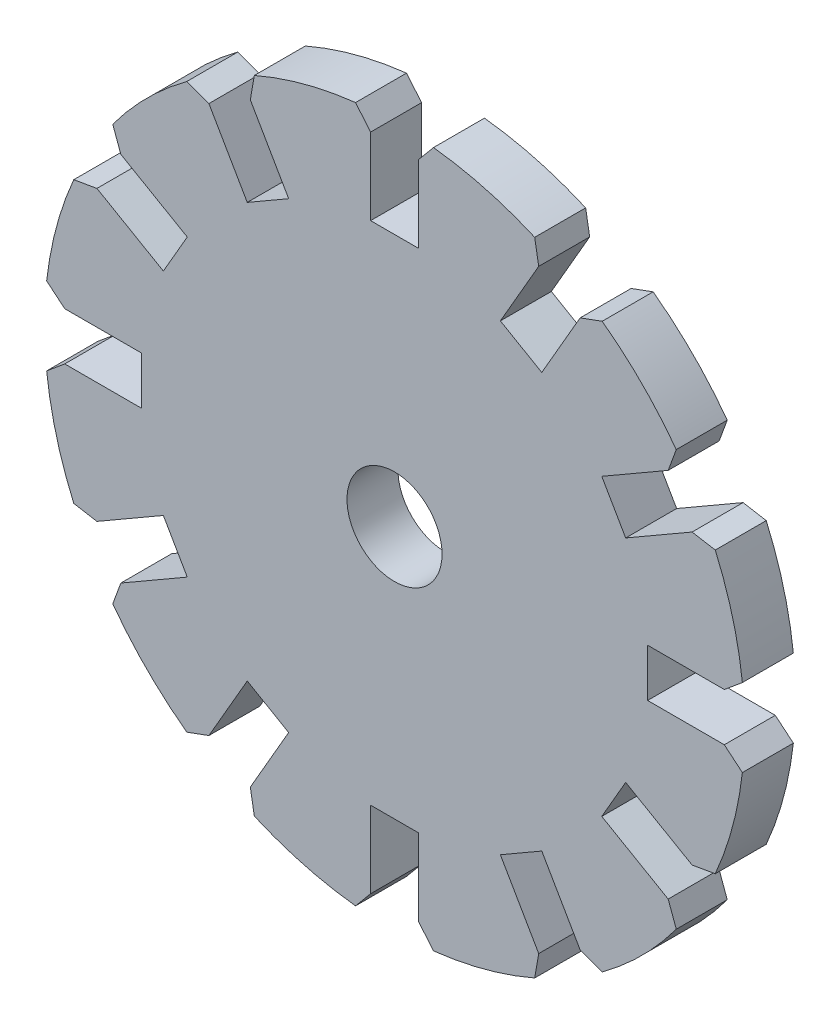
ISO-10303-21;
HEADER;
FILE_DESCRIPTION(('STEP AP214'),'2;1');
FILE_NAME('part.step','',(''),(''),'','','');
FILE_SCHEMA(('AUTOMOTIVE_DESIGN { 1 0 10303 214 1 1 1 1 }'));
ENDSEC;
DATA;
#1=APPLICATION_CONTEXT('core data for automotive mechanical design processes');
#2=APPLICATION_PROTOCOL_DEFINITION('international standard','automotive_design',2000,#1);
#3=PRODUCT_CONTEXT('',#1,'mechanical');
#4=PRODUCT('Part','Part','',(#3));
#5=PRODUCT_RELATED_PRODUCT_CATEGORY('part','',(#4));
#6=PRODUCT_DEFINITION_FORMATION('','',#4);
#7=PRODUCT_DEFINITION_CONTEXT('part definition',#1,'design');
#8=PRODUCT_DEFINITION('design','',#6,#7);
#9=PRODUCT_DEFINITION_SHAPE('','',#8);
#10=(LENGTH_UNIT() NAMED_UNIT(*) SI_UNIT(.MILLI.,.METRE.));
#11=(NAMED_UNIT(*) PLANE_ANGLE_UNIT() SI_UNIT($,.RADIAN.));
#12=(NAMED_UNIT(*) SI_UNIT($,.STERADIAN.) SOLID_ANGLE_UNIT());
#13=UNCERTAINTY_MEASURE_WITH_UNIT(LENGTH_MEASURE(1.E-05),#10,'distance_accuracy_value','');
#14=(GEOMETRIC_REPRESENTATION_CONTEXT(3) GLOBAL_UNCERTAINTY_ASSIGNED_CONTEXT((#13)) GLOBAL_UNIT_ASSIGNED_CONTEXT((#10,
#11,#12)) REPRESENTATION_CONTEXT('',''));
#15=CARTESIAN_POINT('',(0.,0.,0.));
#16=DIRECTION('',(0.,0.,1.));
#17=DIRECTION('',(1.,0.,0.));
#18=AXIS2_PLACEMENT_3D('',#15,#16,#17);
#19=CARTESIAN_POINT('',(-272.569399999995,115.538199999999,5.36));
#20=DIRECTION('',(0.,0.,-1.));
#21=DIRECTION('',(-1.,0.,0.));
#22=AXIS2_PLACEMENT_3D('',#19,#20,#21);
#23=CYLINDRICAL_SURFACE('',#22,36.810669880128);
#24=CARTESIAN_POINT('',(-272.569399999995,115.538199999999,0.));
#25=DIRECTION('',(0.,0.,1.));
#26=DIRECTION('',(1.,0.,0.));
#27=AXIS2_PLACEMENT_3D('',#24,#25,#26);
#28=CIRCLE('',#27,36.810669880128);
#29=CARTESIAN_POINT('',(-287.310997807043,149.268167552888,0.));
#30=VERTEX_POINT('',#29);
#31=CARTESIAN_POINT('',(-276.667785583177,152.120007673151,0.));
#32=VERTEX_POINT('',#31);
#33=EDGE_CURVE('E516',#30,#32,#28,.F.);
#34=ORIENTED_EDGE('',*,*,#33,.F.);
#35=DIRECTION('',(0.,0.,-1.));
#36=VECTOR('',#35,1.);
#37=CARTESIAN_POINT('',(-287.310997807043,149.268167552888,5.36));
#38=LINE('',#37,#36);
#39=CARTESIAN_POINT('',(-287.310997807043,149.268167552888,5.36));
#40=VERTEX_POINT('',#39);
#41=EDGE_CURVE('E11',#40,#30,#38,.T.);
#42=ORIENTED_EDGE('',*,*,#41,.F.);
#43=CARTESIAN_POINT('',(-272.569399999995,115.538199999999,5.36));
#44=DIRECTION('',(0.,0.,1.));
#45=DIRECTION('',(1.,0.,0.));
#46=AXIS2_PLACEMENT_3D('',#43,#44,#45);
#47=CIRCLE('',#46,36.810669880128);
#48=CARTESIAN_POINT('',(-276.667785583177,152.120007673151,5.36));
#49=VERTEX_POINT('',#48);
#50=EDGE_CURVE('E719',#40,#49,#47,.F.);
#51=ORIENTED_EDGE('',*,*,#50,.T.);
#52=DIRECTION('',(0.,0.,-1.));
#53=VECTOR('',#52,1.);
#54=CARTESIAN_POINT('',(-276.667785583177,152.120007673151,5.36));
#55=LINE('',#54,#53);
#56=EDGE_CURVE('E51',#49,#32,#55,.T.);
#57=ORIENTED_EDGE('',*,*,#56,.T.);
#58=EDGE_LOOP('',(#34,#42,#51,#57));
#59=FACE_BOUND('',#58,.T.);
#60=ADVANCED_FACE('F35',(#59),#23,.T.);
#61=CARTESIAN_POINT('',(-304.048278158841,52.6954149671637,5.36));
#62=DIRECTION('',(0.985311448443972,-0.170766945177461,0.));
#63=DIRECTION('',(0.170766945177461,0.985311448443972,0.));
#64=AXIS2_PLACEMENT_3D('',#61,#62,#63);
#65=PLANE('',#64);
#66=DIRECTION('',(-0.170766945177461,-0.985311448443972,0.));
#67=VECTOR('',#66,1.);
#68=CARTESIAN_POINT('',(-304.048278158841,52.6954149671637,0.));
#69=LINE('',#68,#67);
#70=CARTESIAN_POINT('',(-287.733149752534,146.832385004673,0.));
#71=VERTEX_POINT('',#70);
#72=EDGE_CURVE('E518',#30,#71,#69,.T.);
#73=ORIENTED_EDGE('',*,*,#72,.T.);
#74=DIRECTION('',(0.,0.,-1.));
#75=VECTOR('',#74,1.);
#76=CARTESIAN_POINT('',(-287.733149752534,146.832385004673,5.36));
#77=LINE('',#76,#75);
#78=CARTESIAN_POINT('',(-287.733149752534,146.832385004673,5.36));
#79=VERTEX_POINT('',#78);
#80=EDGE_CURVE('E43',#79,#71,#77,.T.);
#81=ORIENTED_EDGE('',*,*,#80,.F.);
#82=DIRECTION('',(-0.170766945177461,-0.985311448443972,0.));
#83=VECTOR('',#82,1.);
#84=CARTESIAN_POINT('',(-304.048278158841,52.6954149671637,5.36));
#85=LINE('',#84,#83);
#86=EDGE_CURVE('E891',#40,#79,#85,.T.);
#87=ORIENTED_EDGE('',*,*,#86,.F.);
#88=ORIENTED_EDGE('',*,*,#41,.T.);
#89=EDGE_LOOP('',(#73,#81,#87,#88));
#90=FACE_BOUND('',#89,.T.);
#91=ADVANCED_FACE('F1083',(#90),#65,.F.);
#92=CARTESIAN_POINT('',(-152.219574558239,-87.8840123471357,5.36));
#93=DIRECTION('',(0.866025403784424,0.500000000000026,0.));
#94=DIRECTION('',(-0.500000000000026,0.866025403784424,0.));
#95=AXIS2_PLACEMENT_3D('',#92,#93,#94);
#96=PLANE('',#95);
#97=DIRECTION('',(0.500000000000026,-0.866025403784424,0.));
#98=VECTOR('',#97,1.);
#99=CARTESIAN_POINT('',(-152.219574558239,-87.8840123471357,0.));
#100=LINE('',#99,#98);
#101=CARTESIAN_POINT('',(-283.700382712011,139.847427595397,0.));
#102=VERTEX_POINT('',#101);
#103=EDGE_CURVE('E520',#71,#102,#100,.T.);
#104=ORIENTED_EDGE('',*,*,#103,.T.);
#105=DIRECTION('',(0.,0.,-1.));
#106=VECTOR('',#105,1.);
#107=CARTESIAN_POINT('',(-283.700382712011,139.847427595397,5.36));
#108=LINE('',#107,#106);
#109=CARTESIAN_POINT('',(-283.700382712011,139.847427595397,5.36));
#110=VERTEX_POINT('',#109);
#111=EDGE_CURVE('E864',#110,#102,#108,.T.);
#112=ORIENTED_EDGE('',*,*,#111,.F.);
#113=DIRECTION('',(0.500000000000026,-0.866025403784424,0.));
#114=VECTOR('',#113,1.);
#115=CARTESIAN_POINT('',(-152.219574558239,-87.8840123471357,5.36));
#116=LINE('',#115,#114);
#117=EDGE_CURVE('E872',#79,#110,#116,.T.);
#118=ORIENTED_EDGE('',*,*,#117,.F.);
#119=ORIENTED_EDGE('',*,*,#80,.T.);
#120=EDGE_LOOP('',(#104,#112,#118,#119));
#121=FACE_BOUND('',#120,.T.);
#122=ADVANCED_FACE('F870',(#121),#96,.F.);
#123=CARTESIAN_POINT('',(-131.480808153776,227.731439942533,5.36));
#124=DIRECTION('',(-0.500000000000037,0.866025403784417,0.));
#125=DIRECTION('',(-0.866025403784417,-0.500000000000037,0.));
#126=AXIS2_PLACEMENT_3D('',#123,#124,#125);
#127=PLANE('',#126);
#128=DIRECTION('',(0.866025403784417,0.500000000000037,0.));
#129=VECTOR('',#128,1.);
#130=CARTESIAN_POINT('',(-131.480808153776,227.731439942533,0.));
#131=LINE('',#130,#129);
#132=CARTESIAN_POINT('',(-288.056317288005,137.332527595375,0.));
#133=VERTEX_POINT('',#132);
#134=EDGE_CURVE('E523',#133,#102,#131,.T.);
#135=ORIENTED_EDGE('',*,*,#134,.F.);
#136=DIRECTION('',(0.,0.,-1.));
#137=VECTOR('',#136,1.);
#138=CARTESIAN_POINT('',(-288.056317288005,137.332527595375,5.36));
#139=LINE('',#138,#137);
#140=CARTESIAN_POINT('',(-288.056317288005,137.332527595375,5.36));
#141=VERTEX_POINT('',#140);
#142=EDGE_CURVE('E862',#141,#133,#139,.T.);
#143=ORIENTED_EDGE('',*,*,#142,.F.);
#144=DIRECTION('',(0.866025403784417,0.500000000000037,0.));
#145=VECTOR('',#144,1.);
#146=CARTESIAN_POINT('',(-131.480808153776,227.731439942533,5.36));
#147=LINE('',#146,#145);
#148=EDGE_CURVE('E884',#141,#110,#147,.T.);
#149=ORIENTED_EDGE('',*,*,#148,.T.);
#150=ORIENTED_EDGE('',*,*,#111,.T.);
#151=EDGE_LOOP('',(#135,#143,#149,#150));
#152=FACE_BOUND('',#151,.T.);
#153=ADVANCED_FACE('F881',(#152),#127,.T.);
#154=CARTESIAN_POINT('',(-156.575509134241,-90.3989123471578,5.36));
#155=DIRECTION('',(0.866025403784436,0.500000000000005,0.));
#156=DIRECTION('',(-0.500000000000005,0.866025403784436,0.));
#157=AXIS2_PLACEMENT_3D('',#154,#155,#156);
#158=PLANE('',#157);
#159=DIRECTION('',(0.500000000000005,-0.866025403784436,0.));
#160=VECTOR('',#159,1.);
#161=CARTESIAN_POINT('',(-156.575509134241,-90.3989123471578,0.));
#162=LINE('',#161,#160);
#163=CARTESIAN_POINT('',(-292.089086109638,144.317488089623,0.));
#164=VERTEX_POINT('',#163);
#165=EDGE_CURVE('E526',#164,#133,#162,.T.);
#166=ORIENTED_EDGE('',*,*,#165,.F.);
#167=DIRECTION('',(0.,0.,-1.));
#168=VECTOR('',#167,1.);
#169=CARTESIAN_POINT('',(-292.089086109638,144.317488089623,5.36));
#170=LINE('',#169,#168);
#171=CARTESIAN_POINT('',(-292.089086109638,144.317488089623,5.36));
#172=VERTEX_POINT('',#171);
#173=EDGE_CURVE('E860',#172,#164,#170,.T.);
#174=ORIENTED_EDGE('',*,*,#173,.F.);
#175=DIRECTION('',(0.500000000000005,-0.866025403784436,0.));
#176=VECTOR('',#175,1.);
#177=CARTESIAN_POINT('',(-156.575509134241,-90.3989123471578,5.36));
#178=LINE('',#177,#176);
#179=EDGE_CURVE('E887',#172,#141,#178,.T.);
#180=ORIENTED_EDGE('',*,*,#179,.T.);
#181=ORIENTED_EDGE('',*,*,#142,.T.);
#182=EDGE_LOOP('',(#166,#174,#180,#181));
#183=FACE_BOUND('',#182,.T.);
#184=ADVANCED_FACE('F1094',(#183),#158,.T.);
#185=CARTESIAN_POINT('',(11.9863828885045,32.6350885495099,5.36));
#186=DIRECTION('',(0.344766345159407,0.938688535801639,0.));
#187=DIRECTION('',(-0.938688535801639,0.344766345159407,0.));
#188=AXIS2_PLACEMENT_3D('',#185,#186,#187);
#189=PLANE('',#188);
#190=DIRECTION('',(0.938688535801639,-0.344766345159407,0.));
#191=VECTOR('',#190,1.);
#192=CARTESIAN_POINT('',(11.9863828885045,32.6350885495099,0.));
#193=LINE('',#192,#191);
#194=CARTESIAN_POINT('',(-294.409609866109,145.169781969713,0.));
#195=VERTEX_POINT('',#194);
#196=EDGE_CURVE('E529',#195,#164,#193,.T.);
#197=ORIENTED_EDGE('',*,*,#196,.F.);
#198=DIRECTION('',(0.,0.,-1.));
#199=VECTOR('',#198,1.);
#200=CARTESIAN_POINT('',(-294.409609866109,145.169781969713,5.36));
#201=LINE('',#200,#199);
#202=CARTESIAN_POINT('',(-294.409609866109,145.169781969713,5.36));
#203=VERTEX_POINT('',#202);
#204=EDGE_CURVE('E858',#203,#195,#201,.T.);
#205=ORIENTED_EDGE('',*,*,#204,.F.);
#206=DIRECTION('',(0.938688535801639,-0.344766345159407,0.));
#207=VECTOR('',#206,1.);
#208=CARTESIAN_POINT('',(11.9863828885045,32.6350885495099,5.36));
#209=LINE('',#208,#207);
#210=EDGE_CURVE('E889',#203,#172,#209,.T.);
#211=ORIENTED_EDGE('',*,*,#210,.T.);
#212=ORIENTED_EDGE('',*,*,#173,.T.);
#213=EDGE_LOOP('',(#197,#205,#211,#212));
#214=FACE_BOUND('',#213,.T.);
#215=ADVANCED_FACE('F1097',(#214),#189,.T.);
#216=CARTESIAN_POINT('',(-272.569399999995,115.538199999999,5.36));
#217=DIRECTION('',(0.,0.,-1.));
#218=DIRECTION('',(-1.,0.,0.));
#219=AXIS2_PLACEMENT_3D('',#216,#217,#218);
#220=CYLINDRICAL_SURFACE('',#219,36.8106698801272);
#221=CARTESIAN_POINT('',(-272.569399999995,115.538199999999,0.));
#222=DIRECTION('',(0.,0.,1.));
#223=DIRECTION('',(1.,0.,0.));
#224=AXIS2_PLACEMENT_3D('',#221,#222,#223);
#225=CIRCLE('',#224,36.8106698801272);
#226=CARTESIAN_POINT('',(-302.200981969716,137.378409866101,0.));
#227=VERTEX_POINT('',#226);
#228=EDGE_CURVE('E532',#227,#195,#225,.F.);
#229=ORIENTED_EDGE('',*,*,#228,.F.);
#230=DIRECTION('',(0.,0.,-1.));
#231=VECTOR('',#230,1.);
#232=CARTESIAN_POINT('',(-302.200981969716,137.378409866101,5.36));
#233=LINE('',#232,#231);
#234=CARTESIAN_POINT('',(-302.200981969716,137.378409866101,5.36));
#235=VERTEX_POINT('',#234);
#236=EDGE_CURVE('E856',#235,#227,#233,.T.);
#237=ORIENTED_EDGE('',*,*,#236,.F.);
#238=CARTESIAN_POINT('',(-272.569399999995,115.538199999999,5.36));
#239=DIRECTION('',(0.,0.,1.));
#240=DIRECTION('',(1.,0.,0.));
#241=AXIS2_PLACEMENT_3D('',#238,#239,#240);
#242=CIRCLE('',#241,36.8106698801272);
#243=EDGE_CURVE('E897',#235,#203,#242,.F.);
#244=ORIENTED_EDGE('',*,*,#243,.T.);
#245=ORIENTED_EDGE('',*,*,#204,.T.);
#246=EDGE_LOOP('',(#229,#237,#244,#245));
#247=FACE_BOUND('',#246,.T.);
#248=ADVANCED_FACE('F1101',(#247),#220,.T.);
#249=CARTESIAN_POINT('',(-221.820408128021,-81.4715708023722,5.36));
#250=DIRECTION('',(0.938688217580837,0.34476721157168,0.));
#251=DIRECTION('',(-0.34476721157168,0.938688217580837,0.));
#252=AXIS2_PLACEMENT_3D('',#249,#250,#251);
#253=PLANE('',#252);
#254=DIRECTION('',(0.34476721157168,-0.938688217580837,0.));
#255=VECTOR('',#254,1.);
#256=CARTESIAN_POINT('',(-221.820408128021,-81.4715708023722,0.));
#257=LINE('',#256,#255);
#258=CARTESIAN_POINT('',(-301.348685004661,135.057884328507,0.));
#259=VERTEX_POINT('',#258);
#260=EDGE_CURVE('E535',#227,#259,#257,.T.);
#261=ORIENTED_EDGE('',*,*,#260,.T.);
#262=DIRECTION('',(0.,0.,-1.));
#263=VECTOR('',#262,1.);
#264=CARTESIAN_POINT('',(-301.348685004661,135.057884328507,5.36));
#265=LINE('',#264,#263);
#266=CARTESIAN_POINT('',(-301.348685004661,135.057884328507,5.36));
#267=VERTEX_POINT('',#266);
#268=EDGE_CURVE('E853',#267,#259,#265,.T.);
#269=ORIENTED_EDGE('',*,*,#268,.F.);
#270=DIRECTION('',(0.34476721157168,-0.938688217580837,0.));
#271=VECTOR('',#270,1.);
#272=CARTESIAN_POINT('',(-221.820408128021,-81.4715708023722,5.36));
#273=LINE('',#272,#271);
#274=EDGE_CURVE('E900',#235,#267,#273,.T.);
#275=ORIENTED_EDGE('',*,*,#274,.F.);
#276=ORIENTED_EDGE('',*,*,#236,.T.);
#277=EDGE_LOOP('',(#261,#269,#275,#276));
#278=FACE_BOUND('',#277,.T.);
#279=ADVANCED_FACE('F1105',(#278),#253,.F.);
#280=CARTESIAN_POINT('',(-16.8553918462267,-29.1943950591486,5.36));
#281=DIRECTION('',(0.499999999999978,0.866025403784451,0.));
#282=DIRECTION('',(-0.866025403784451,0.499999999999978,0.));
#283=AXIS2_PLACEMENT_3D('',#280,#281,#282);
#284=PLANE('',#283);
#285=DIRECTION('',(0.866025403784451,-0.499999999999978,0.));
#286=VECTOR('',#285,1.);
#287=CARTESIAN_POINT('',(-16.8553918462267,-29.1943950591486,0.));
#288=LINE('',#287,#286);
#289=CARTESIAN_POINT('',(-294.363727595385,131.025117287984,0.));
#290=VERTEX_POINT('',#289);
#291=EDGE_CURVE('E537',#259,#290,#288,.T.);
#292=ORIENTED_EDGE('',*,*,#291,.T.);
#293=DIRECTION('',(0.,0.,-1.));
#294=VECTOR('',#293,1.);
#295=CARTESIAN_POINT('',(-294.363727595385,131.025117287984,5.36));
#296=LINE('',#295,#294);
#297=CARTESIAN_POINT('',(-294.363727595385,131.025117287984,5.36));
#298=VERTEX_POINT('',#297);
#299=EDGE_CURVE('E851',#298,#290,#296,.T.);
#300=ORIENTED_EDGE('',*,*,#299,.F.);
#301=DIRECTION('',(0.866025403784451,-0.499999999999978,0.));
#302=VECTOR('',#301,1.);
#303=CARTESIAN_POINT('',(-16.8553918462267,-29.1943950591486,5.36));
#304=LINE('',#303,#302);
#305=EDGE_CURVE('E902',#267,#298,#304,.T.);
#306=ORIENTED_EDGE('',*,*,#305,.F.);
#307=ORIENTED_EDGE('',*,*,#268,.T.);
#308=EDGE_LOOP('',(#292,#300,#306,#307));
#309=FACE_BOUND('',#308,.T.);
#310=ADVANCED_FACE('F1109',(#309),#284,.F.);
#311=CARTESIAN_POINT('',(-277.508335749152,160.219512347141,5.36));
#312=DIRECTION('',(-0.866025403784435,0.500000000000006,0.));
#313=DIRECTION('',(-0.500000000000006,-0.866025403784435,0.));
#314=AXIS2_PLACEMENT_3D('',#311,#312,#313);
#315=PLANE('',#314);
#316=DIRECTION('',(0.500000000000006,0.866025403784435,0.));
#317=VECTOR('',#316,1.);
#318=CARTESIAN_POINT('',(-277.508335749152,160.219512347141,0.));
#319=LINE('',#318,#317);
#320=CARTESIAN_POINT('',(-296.878627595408,126.66918271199,0.));
#321=VERTEX_POINT('',#320);
#322=EDGE_CURVE('E540',#321,#290,#319,.T.);
#323=ORIENTED_EDGE('',*,*,#322,.F.);
#324=DIRECTION('',(0.,0.,-1.));
#325=VECTOR('',#324,1.);
#326=CARTESIAN_POINT('',(-296.878627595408,126.66918271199,5.36));
#327=LINE('',#326,#325);
#328=CARTESIAN_POINT('',(-296.878627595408,126.66918271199,5.36));
#329=VERTEX_POINT('',#328);
#330=EDGE_CURVE('E849',#329,#321,#327,.T.);
#331=ORIENTED_EDGE('',*,*,#330,.F.);
#332=DIRECTION('',(0.500000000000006,0.866025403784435,0.));
#333=VECTOR('',#332,1.);
#334=CARTESIAN_POINT('',(-277.508335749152,160.219512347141,5.36));
#335=LINE('',#334,#333);
#336=EDGE_CURVE('E904',#329,#298,#335,.T.);
#337=ORIENTED_EDGE('',*,*,#336,.T.);
#338=ORIENTED_EDGE('',*,*,#299,.T.);
#339=EDGE_LOOP('',(#323,#331,#337,#338));
#340=FACE_BOUND('',#339,.T.);
#341=ADVANCED_FACE('F1113',(#340),#315,.T.);
#342=CARTESIAN_POINT('',(-19.3702918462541,-33.5503296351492,5.36));
#343=DIRECTION('',(0.500000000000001,0.866025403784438,0.));
#344=DIRECTION('',(-0.866025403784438,0.500000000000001,0.));
#345=AXIS2_PLACEMENT_3D('',#342,#343,#344);
#346=PLANE('',#345);
#347=DIRECTION('',(0.866025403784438,-0.500000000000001,0.));
#348=VECTOR('',#347,1.);
#349=CARTESIAN_POINT('',(-19.3702918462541,-33.5503296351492,0.));
#350=LINE('',#349,#348);
#351=CARTESIAN_POINT('',(-303.863588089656,130.701951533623,0.));
#352=VERTEX_POINT('',#351);
#353=EDGE_CURVE('E543',#352,#321,#350,.T.);
#354=ORIENTED_EDGE('',*,*,#353,.F.);
#355=DIRECTION('',(0.,0.,-1.));
#356=VECTOR('',#355,1.);
#357=CARTESIAN_POINT('',(-303.863588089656,130.701951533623,5.36));
#358=LINE('',#357,#356);
#359=CARTESIAN_POINT('',(-303.863588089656,130.701951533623,5.36));
#360=VERTEX_POINT('',#359);
#361=EDGE_CURVE('E847',#360,#352,#358,.T.);
#362=ORIENTED_EDGE('',*,*,#361,.F.);
#363=DIRECTION('',(0.866025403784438,-0.500000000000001,0.));
#364=VECTOR('',#363,1.);
#365=CARTESIAN_POINT('',(-19.3702918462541,-33.5503296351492,5.36));
#366=LINE('',#365,#364);
#367=EDGE_CURVE('E907',#360,#329,#366,.T.);
#368=ORIENTED_EDGE('',*,*,#367,.T.);
#369=ORIENTED_EDGE('',*,*,#330,.T.);
#370=EDGE_LOOP('',(#354,#362,#368,#369));
#371=FACE_BOUND('',#370,.T.);
#372=ADVANCED_FACE('F1117',(#371),#346,.T.);
#373=CARTESIAN_POINT('',(-30.8530110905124,178.018399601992,5.36));
#374=DIRECTION('',(-0.170767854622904,0.985311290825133,0.));
#375=DIRECTION('',(-0.985311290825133,-0.170767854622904,0.));
#376=AXIS2_PLACEMENT_3D('',#373,#374,#375);
#377=PLANE('',#376);
#378=DIRECTION('',(0.985311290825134,0.170767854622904,0.));
#379=VECTOR('',#378,1.);
#380=CARTESIAN_POINT('',(-30.8530110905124,178.018399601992,0.));
#381=LINE('',#380,#379);
#382=CARTESIAN_POINT('',(-306.29936755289,130.279797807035,0.));
#383=VERTEX_POINT('',#382);
#384=EDGE_CURVE('E546',#383,#352,#381,.T.);
#385=ORIENTED_EDGE('',*,*,#384,.F.);
#386=DIRECTION('',(0.,0.,-1.));
#387=VECTOR('',#386,1.);
#388=CARTESIAN_POINT('',(-306.29936755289,130.279797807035,5.36));
#389=LINE('',#388,#387);
#390=CARTESIAN_POINT('',(-306.29936755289,130.279797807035,5.36));
#391=VERTEX_POINT('',#390);
#392=EDGE_CURVE('E845',#391,#383,#389,.T.);
#393=ORIENTED_EDGE('',*,*,#392,.F.);
#394=DIRECTION('',(0.985311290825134,0.170767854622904,0.));
#395=VECTOR('',#394,1.);
#396=CARTESIAN_POINT('',(-30.8530110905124,178.018399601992,5.36));
#397=LINE('',#396,#395);
#398=EDGE_CURVE('E910',#391,#360,#397,.T.);
#399=ORIENTED_EDGE('',*,*,#398,.T.);
#400=ORIENTED_EDGE('',*,*,#361,.T.);
#401=EDGE_LOOP('',(#385,#393,#399,#400));
#402=FACE_BOUND('',#401,.T.);
#403=ADVANCED_FACE('F1121',(#402),#377,.T.);
#404=CARTESIAN_POINT('',(-272.569399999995,115.538199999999,5.36));
#405=DIRECTION('',(0.,0.,-1.));
#406=DIRECTION('',(-1.,0.,0.));
#407=AXIS2_PLACEMENT_3D('',#404,#405,#406);
#408=CYLINDRICAL_SURFACE('',#407,36.8106698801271);
#409=CARTESIAN_POINT('',(-272.569399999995,115.538199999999,0.));
#410=DIRECTION('',(0.,0.,1.));
#411=DIRECTION('',(1.,0.,0.));
#412=AXIS2_PLACEMENT_3D('',#409,#410,#411);
#413=CIRCLE('',#412,36.8106698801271);
#414=CARTESIAN_POINT('',(-309.151207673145,119.636585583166,0.));
#415=VERTEX_POINT('',#414);
#416=EDGE_CURVE('E549',#415,#383,#413,.F.);
#417=ORIENTED_EDGE('',*,*,#416,.F.);
#418=DIRECTION('',(0.,0.,-1.));
#419=VECTOR('',#418,1.);
#420=CARTESIAN_POINT('',(-309.151207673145,119.636585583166,5.36));
#421=LINE('',#420,#419);
#422=CARTESIAN_POINT('',(-309.151207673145,119.636585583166,5.36));
#423=VERTEX_POINT('',#422);
#424=EDGE_CURVE('E843',#423,#415,#421,.T.);
#425=ORIENTED_EDGE('',*,*,#424,.F.);
#426=CARTESIAN_POINT('',(-272.569399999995,115.538199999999,5.36));
#427=DIRECTION('',(0.,0.,1.));
#428=DIRECTION('',(1.,0.,0.));
#429=AXIS2_PLACEMENT_3D('',#426,#427,#428);
#430=CIRCLE('',#429,36.8106698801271);
#431=EDGE_CURVE('E913',#423,#391,#430,.F.);
#432=ORIENTED_EDGE('',*,*,#431,.T.);
#433=ORIENTED_EDGE('',*,*,#392,.T.);
#434=EDGE_LOOP('',(#417,#425,#432,#433));
#435=FACE_BOUND('',#434,.T.);
#436=ADVANCED_FACE('F1125',(#435),#408,.T.);
#437=CARTESIAN_POINT('',(-67.9960417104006,-81.5175656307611,5.36));
#438=DIRECTION('',(0.640544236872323,0.767921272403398,0.));
#439=DIRECTION('',(-0.767921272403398,0.640544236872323,0.));
#440=AXIS2_PLACEMENT_3D('',#437,#438,#439);
#441=PLANE('',#440);
#442=DIRECTION('',(0.767921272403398,-0.640544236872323,0.));
#443=VECTOR('',#442,1.);
#444=CARTESIAN_POINT('',(-67.9960417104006,-81.5175656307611,0.));
#445=LINE('',#444,#443);
#446=CARTESIAN_POINT('',(-307.252834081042,118.053100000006,0.));
#447=VERTEX_POINT('',#446);
#448=EDGE_CURVE('E552',#415,#447,#445,.T.);
#449=ORIENTED_EDGE('',*,*,#448,.T.);
#450=DIRECTION('',(0.,0.,-1.));
#451=VECTOR('',#450,1.);
#452=CARTESIAN_POINT('',(-307.252834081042,118.053100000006,5.36));
#453=LINE('',#452,#451);
#454=CARTESIAN_POINT('',(-307.252834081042,118.053100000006,5.36));
#455=VERTEX_POINT('',#454);
#456=EDGE_CURVE('E840',#455,#447,#453,.T.);
#457=ORIENTED_EDGE('',*,*,#456,.F.);
#458=DIRECTION('',(0.767921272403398,-0.640544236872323,0.));
#459=VECTOR('',#458,1.);
#460=CARTESIAN_POINT('',(-67.9960417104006,-81.5175656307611,5.36));
#461=LINE('',#460,#459);
#462=EDGE_CURVE('E916',#423,#455,#461,.T.);
#463=ORIENTED_EDGE('',*,*,#462,.F.);
#464=ORIENTED_EDGE('',*,*,#424,.T.);
#465=EDGE_LOOP('',(#449,#457,#463,#464));
#466=FACE_BOUND('',#465,.T.);
#467=ADVANCED_FACE('F1129',(#466),#441,.F.);
#468=CARTESIAN_POINT('',(-4.06251056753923E-12,118.053100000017,5.36));
#469=DIRECTION('',(0.,1.,0.));
#470=DIRECTION('',(-1.,0.,0.));
#471=AXIS2_PLACEMENT_3D('',#468,#469,#470);
#472=PLANE('',#471);
#473=DIRECTION('',(1.,0.,0.));
#474=VECTOR('',#473,1.);
#475=CARTESIAN_POINT('',(-4.06251056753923E-12,118.053100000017,0.));
#476=LINE('',#475,#474);
#477=CARTESIAN_POINT('',(-299.187299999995,118.053100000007,0.));
#478=VERTEX_POINT('',#477);
#479=EDGE_CURVE('E554',#447,#478,#476,.T.);
#480=ORIENTED_EDGE('',*,*,#479,.T.);
#481=DIRECTION('',(0.,0.,-1.));
#482=VECTOR('',#481,1.);
#483=CARTESIAN_POINT('',(-299.187299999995,118.053100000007,5.36));
#484=LINE('',#483,#482);
#485=CARTESIAN_POINT('',(-299.187299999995,118.053100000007,5.36));
#486=VERTEX_POINT('',#485);
#487=EDGE_CURVE('E838',#486,#478,#484,.T.);
#488=ORIENTED_EDGE('',*,*,#487,.F.);
#489=DIRECTION('',(1.,0.,0.));
#490=VECTOR('',#489,1.);
#491=CARTESIAN_POINT('',(-4.06251056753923E-12,118.053100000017,5.36));
#492=LINE('',#491,#490);
#493=EDGE_CURVE('E918',#455,#486,#492,.T.);
#494=ORIENTED_EDGE('',*,*,#493,.F.);
#495=ORIENTED_EDGE('',*,*,#456,.T.);
#496=EDGE_LOOP('',(#480,#488,#494,#495));
#497=FACE_BOUND('',#496,.T.);
#498=ADVANCED_FACE('F1133',(#497),#472,.F.);
#499=CARTESIAN_POINT('',(-299.187299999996,3.30196657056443E-12,5.36));
#500=DIRECTION('',(-1.,0.,0.));
#501=DIRECTION('',(0.,-1.,0.));
#502=AXIS2_PLACEMENT_3D('',#499,#500,#501);
#503=PLANE('',#502);
#504=DIRECTION('',(0.,1.,0.));
#505=VECTOR('',#504,1.);
#506=CARTESIAN_POINT('',(-299.187299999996,3.30196657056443E-12,0.));
#507=LINE('',#506,#505);
#508=CARTESIAN_POINT('',(-299.187299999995,113.023299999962,0.));
#509=VERTEX_POINT('',#508);
#510=EDGE_CURVE('E557',#509,#478,#507,.T.);
#511=ORIENTED_EDGE('',*,*,#510,.F.);
#512=DIRECTION('',(0.,0.,-1.));
#513=VECTOR('',#512,1.);
#514=CARTESIAN_POINT('',(-299.187299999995,113.023299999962,5.36));
#515=LINE('',#514,#513);
#516=CARTESIAN_POINT('',(-299.187299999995,113.023299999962,5.36));
#517=VERTEX_POINT('',#516);
#518=EDGE_CURVE('E836',#517,#509,#515,.T.);
#519=ORIENTED_EDGE('',*,*,#518,.F.);
#520=DIRECTION('',(0.,1.,0.));
#521=VECTOR('',#520,1.);
#522=CARTESIAN_POINT('',(-299.187299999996,3.30196657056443E-12,5.36));
#523=LINE('',#522,#521);
#524=EDGE_CURVE('E920',#517,#486,#523,.T.);
#525=ORIENTED_EDGE('',*,*,#524,.T.);
#526=ORIENTED_EDGE('',*,*,#487,.T.);
#527=EDGE_LOOP('',(#511,#519,#525,#526));
#528=FACE_BOUND('',#527,.T.);
#529=ADVANCED_FACE('F1137',(#528),#503,.T.);
#530=CARTESIAN_POINT('',(0.,113.023299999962,5.36));
#531=DIRECTION('',(0.,1.,0.));
#532=DIRECTION('',(0.,0.,1.));
#533=AXIS2_PLACEMENT_3D('',#530,#531,#532);
#534=PLANE('',#533);
#535=DIRECTION('',(1.,0.,0.));
#536=VECTOR('',#535,1.);
#537=CARTESIAN_POINT('',(0.,113.023299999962,0.));
#538=LINE('',#537,#536);
#539=CARTESIAN_POINT('',(-307.252837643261,113.023299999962,0.));
#540=VERTEX_POINT('',#539);
#541=EDGE_CURVE('E560',#540,#509,#538,.T.);
#542=ORIENTED_EDGE('',*,*,#541,.F.);
#543=DIRECTION('',(0.,0.,-1.));
#544=VECTOR('',#543,1.);
#545=CARTESIAN_POINT('',(-307.252837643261,113.023299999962,5.36));
#546=LINE('',#545,#544);
#547=CARTESIAN_POINT('',(-307.252837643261,113.023299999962,5.36));
#548=VERTEX_POINT('',#547);
#549=EDGE_CURVE('E834',#548,#540,#546,.T.);
#550=ORIENTED_EDGE('',*,*,#549,.F.);
#551=DIRECTION('',(1.,0.,0.));
#552=VECTOR('',#551,1.);
#553=CARTESIAN_POINT('',(0.,113.023299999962,5.36));
#554=LINE('',#553,#552);
#555=EDGE_CURVE('E923',#548,#517,#554,.T.);
#556=ORIENTED_EDGE('',*,*,#555,.T.);
#557=ORIENTED_EDGE('',*,*,#518,.T.);
#558=EDGE_LOOP('',(#542,#550,#556,#557));
#559=FACE_BOUND('',#558,.T.);
#560=ADVANCED_FACE('F1141',(#559),#534,.T.);
#561=CARTESIAN_POINT('',(-181.659944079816,217.783980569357,5.36));
#562=DIRECTION('',(-0.640544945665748,0.767920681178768,0.));
#563=DIRECTION('',(-0.767920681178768,-0.640544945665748,0.));
#564=AXIS2_PLACEMENT_3D('',#561,#562,#563);
#565=PLANE('',#564);
#566=DIRECTION('',(0.767920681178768,0.640544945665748,0.));
#567=VECTOR('',#566,1.);
#568=CARTESIAN_POINT('',(-181.659944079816,217.783980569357,0.));
#569=LINE('',#568,#567);
#570=CARTESIAN_POINT('',(-309.151207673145,111.439814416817,0.));
#571=VERTEX_POINT('',#570);
#572=EDGE_CURVE('E563',#571,#540,#569,.T.);
#573=ORIENTED_EDGE('',*,*,#572,.F.);
#574=DIRECTION('',(0.,0.,-1.));
#575=VECTOR('',#574,1.);
#576=CARTESIAN_POINT('',(-309.151207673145,111.439814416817,5.36));
#577=LINE('',#576,#575);
#578=CARTESIAN_POINT('',(-309.151207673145,111.439814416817,5.36));
#579=VERTEX_POINT('',#578);
#580=EDGE_CURVE('E832',#579,#571,#577,.T.);
#581=ORIENTED_EDGE('',*,*,#580,.F.);
#582=DIRECTION('',(0.767920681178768,0.640544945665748,0.));
#583=VECTOR('',#582,1.);
#584=CARTESIAN_POINT('',(-181.659944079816,217.783980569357,5.36));
#585=LINE('',#584,#583);
#586=EDGE_CURVE('E926',#579,#548,#585,.T.);
#587=ORIENTED_EDGE('',*,*,#586,.T.);
#588=ORIENTED_EDGE('',*,*,#549,.T.);
#589=EDGE_LOOP('',(#573,#581,#587,#588));
#590=FACE_BOUND('',#589,.T.);
#591=ADVANCED_FACE('F1145',(#590),#565,.T.);
#592=CARTESIAN_POINT('',(-272.569399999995,115.538199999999,5.36));
#593=DIRECTION('',(0.,0.,-1.));
#594=DIRECTION('',(-1.,0.,0.));
#595=AXIS2_PLACEMENT_3D('',#592,#593,#594);
#596=CYLINDRICAL_SURFACE('',#595,36.8106698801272);
#597=CARTESIAN_POINT('',(-272.569399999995,115.538199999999,0.));
#598=DIRECTION('',(0.,0.,1.));
#599=DIRECTION('',(1.,0.,0.));
#600=AXIS2_PLACEMENT_3D('',#597,#598,#599);
#601=CIRCLE('',#600,36.8106698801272);
#602=CARTESIAN_POINT('',(-306.299367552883,100.79660219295,0.));
#603=VERTEX_POINT('',#602);
#604=EDGE_CURVE('E566',#603,#571,#601,.F.);
#605=ORIENTED_EDGE('',*,*,#604,.F.);
#606=DIRECTION('',(0.,0.,-1.));
#607=VECTOR('',#606,1.);
#608=CARTESIAN_POINT('',(-306.299367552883,100.79660219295,5.36));
#609=LINE('',#608,#607);
#610=CARTESIAN_POINT('',(-306.299367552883,100.79660219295,5.36));
#611=VERTEX_POINT('',#610);
#612=EDGE_CURVE('E830',#611,#603,#609,.T.);
#613=ORIENTED_EDGE('',*,*,#612,.F.);
#614=CARTESIAN_POINT('',(-272.569399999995,115.538199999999,5.36));
#615=DIRECTION('',(0.,0.,1.));
#616=DIRECTION('',(1.,0.,0.));
#617=AXIS2_PLACEMENT_3D('',#614,#615,#616);
#618=CIRCLE('',#617,36.8106698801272);
#619=EDGE_CURVE('E929',#611,#579,#618,.F.);
#620=ORIENTED_EDGE('',*,*,#619,.T.);
#621=ORIENTED_EDGE('',*,*,#580,.T.);
#622=EDGE_LOOP('',(#605,#613,#620,#621));
#623=FACE_BOUND('',#622,.T.);
#624=ADVANCED_FACE('F1149',(#623),#596,.T.);
#625=CARTESIAN_POINT('',(8.02779487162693,46.3197264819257,5.36));
#626=DIRECTION('',(0.170766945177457,0.985311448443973,0.));
#627=DIRECTION('',(-0.985311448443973,0.170766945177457,0.));
#628=AXIS2_PLACEMENT_3D('',#625,#626,#627);
#629=PLANE('',#628);
#630=DIRECTION('',(0.985311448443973,-0.170766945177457,0.));
#631=VECTOR('',#630,1.);
#632=CARTESIAN_POINT('',(8.02779487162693,46.3197264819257,0.));
#633=LINE('',#632,#631);
#634=CARTESIAN_POINT('',(-303.863585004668,100.374450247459,0.));
#635=VERTEX_POINT('',#634);
#636=EDGE_CURVE('E569',#603,#635,#633,.T.);
#637=ORIENTED_EDGE('',*,*,#636,.T.);
#638=DIRECTION('',(0.,0.,-1.));
#639=VECTOR('',#638,1.);
#640=CARTESIAN_POINT('',(-303.863585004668,100.374450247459,5.36));
#641=LINE('',#640,#639);
#642=CARTESIAN_POINT('',(-303.863585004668,100.374450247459,5.36));
#643=VERTEX_POINT('',#642);
#644=EDGE_CURVE('E827',#643,#635,#641,.T.);
#645=ORIENTED_EDGE('',*,*,#644,.F.);
#646=DIRECTION('',(0.985311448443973,-0.170766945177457,0.));
#647=VECTOR('',#646,1.);
#648=CARTESIAN_POINT('',(8.02779487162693,46.3197264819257,5.36));
#649=LINE('',#648,#647);
#650=EDGE_CURVE('E932',#611,#643,#649,.T.);
#651=ORIENTED_EDGE('',*,*,#650,.F.);
#652=ORIENTED_EDGE('',*,*,#612,.T.);
#653=EDGE_LOOP('',(#637,#645,#651,#652));
#654=FACE_BOUND('',#653,.T.);
#655=ADVANCED_FACE('F1153',(#654),#629,.F.);
#656=CARTESIAN_POINT('',(-119.429308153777,206.857629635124,5.36));
#657=DIRECTION('',(-0.500000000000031,0.866025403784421,0.));
#658=DIRECTION('',(-0.866025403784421,-0.500000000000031,0.));
#659=AXIS2_PLACEMENT_3D('',#656,#657,#658);
#660=PLANE('',#659);
#661=DIRECTION('',(0.866025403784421,0.500000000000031,0.));
#662=VECTOR('',#661,1.);
#663=CARTESIAN_POINT('',(-119.429308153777,206.857629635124,0.));
#664=LINE('',#663,#662);
#665=CARTESIAN_POINT('',(-296.878627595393,104.407217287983,0.));
#666=VERTEX_POINT('',#665);
#667=EDGE_CURVE('E571',#635,#666,#664,.T.);
#668=ORIENTED_EDGE('',*,*,#667,.T.);
#669=DIRECTION('',(0.,0.,-1.));
#670=VECTOR('',#669,1.);
#671=CARTESIAN_POINT('',(-296.878627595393,104.407217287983,5.36));
#672=LINE('',#671,#670);
#673=CARTESIAN_POINT('',(-296.878627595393,104.407217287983,5.36));
#674=VERTEX_POINT('',#673);
#675=EDGE_CURVE('E825',#674,#666,#672,.T.);
#676=ORIENTED_EDGE('',*,*,#675,.F.);
#677=DIRECTION('',(0.866025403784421,0.500000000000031,0.));
#678=VECTOR('',#677,1.);
#679=CARTESIAN_POINT('',(-119.429308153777,206.857629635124,5.36));
#680=LINE('',#679,#678);
#681=EDGE_CURVE('E934',#643,#674,#680,.T.);
#682=ORIENTED_EDGE('',*,*,#681,.F.);
#683=ORIENTED_EDGE('',*,*,#644,.T.);
#684=EDGE_LOOP('',(#668,#676,#682,#683));
#685=FACE_BOUND('',#684,.T.);
#686=ADVANCED_FACE('F1157',(#685),#660,.F.);
#687=CARTESIAN_POINT('',(-177.449319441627,-102.450412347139,5.36));
#688=DIRECTION('',(-0.866025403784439,-0.499999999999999,0.));
#689=DIRECTION('',(0.499999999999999,-0.866025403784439,0.));
#690=AXIS2_PLACEMENT_3D('',#687,#688,#689);
#691=PLANE('',#690);
#692=DIRECTION('',(-0.499999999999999,0.86602540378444,0.));
#693=VECTOR('',#692,1.);
#694=CARTESIAN_POINT('',(-177.449319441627,-102.450412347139,0.));
#695=LINE('',#694,#693);
#696=CARTESIAN_POINT('',(-294.363727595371,100.05128271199,0.));
#697=VERTEX_POINT('',#696);
#698=EDGE_CURVE('E574',#697,#666,#695,.T.);
#699=ORIENTED_EDGE('',*,*,#698,.F.);
#700=DIRECTION('',(0.,0.,-1.));
#701=VECTOR('',#700,1.);
#702=CARTESIAN_POINT('',(-294.363727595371,100.05128271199,5.36));
#703=LINE('',#702,#701);
#704=CARTESIAN_POINT('',(-294.363727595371,100.05128271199,5.36));
#705=VERTEX_POINT('',#704);
#706=EDGE_CURVE('E823',#705,#697,#703,.T.);
#707=ORIENTED_EDGE('',*,*,#706,.F.);
#708=DIRECTION('',(-0.499999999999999,0.86602540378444,0.));
#709=VECTOR('',#708,1.);
#710=CARTESIAN_POINT('',(-177.449319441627,-102.450412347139,5.36));
#711=LINE('',#710,#709);
#712=EDGE_CURVE('E936',#705,#674,#711,.T.);
#713=ORIENTED_EDGE('',*,*,#712,.T.);
#714=ORIENTED_EDGE('',*,*,#675,.T.);
#715=EDGE_LOOP('',(#699,#707,#713,#714));
#716=FACE_BOUND('',#715,.T.);
#717=ADVANCED_FACE('F1161',(#716),#691,.T.);
#718=CARTESIAN_POINT('',(-116.914408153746,202.501695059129,5.36));
#719=DIRECTION('',(-0.500000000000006,0.866025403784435,0.));
#720=DIRECTION('',(-0.866025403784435,-0.500000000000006,0.));
#721=AXIS2_PLACEMENT_3D('',#718,#719,#720);
#722=PLANE('',#721);
#723=DIRECTION('',(0.866025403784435,0.500000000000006,0.));
#724=VECTOR('',#723,1.);
#725=CARTESIAN_POINT('',(-116.914408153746,202.501695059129,0.));
#726=LINE('',#725,#724);
#727=CARTESIAN_POINT('',(-301.348688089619,96.0185138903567,0.));
#728=VERTEX_POINT('',#727);
#729=EDGE_CURVE('E577',#728,#697,#726,.T.);
#730=ORIENTED_EDGE('',*,*,#729,.F.);
#731=DIRECTION('',(0.,0.,-1.));
#732=VECTOR('',#731,1.);
#733=CARTESIAN_POINT('',(-301.348688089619,96.0185138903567,5.36));
#734=LINE('',#733,#732);
#735=CARTESIAN_POINT('',(-301.348688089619,96.0185138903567,5.36));
#736=VERTEX_POINT('',#735);
#737=EDGE_CURVE('E821',#736,#728,#734,.T.);
#738=ORIENTED_EDGE('',*,*,#737,.F.);
#739=DIRECTION('',(0.866025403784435,0.500000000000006,0.));
#740=VECTOR('',#739,1.);
#741=CARTESIAN_POINT('',(-116.914408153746,202.501695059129,5.36));
#742=LINE('',#741,#740);
#743=EDGE_CURVE('E939',#736,#705,#742,.T.);
#744=ORIENTED_EDGE('',*,*,#743,.T.);
#745=ORIENTED_EDGE('',*,*,#706,.T.);
#746=EDGE_LOOP('',(#730,#738,#744,#745));
#747=FACE_BOUND('',#746,.T.);
#748=ADVANCED_FACE('F1165',(#747),#722,.T.);
#749=CARTESIAN_POINT('',(-296.603528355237,108.938066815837,5.36));
#750=DIRECTION('',(-0.93868853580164,0.344766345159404,0.));
#751=DIRECTION('',(-0.344766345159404,-0.93868853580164,0.));
#752=AXIS2_PLACEMENT_3D('',#749,#750,#751);
#753=PLANE('',#752);
#754=DIRECTION('',(0.344766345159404,0.93868853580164,0.));
#755=VECTOR('',#754,1.);
#756=CARTESIAN_POINT('',(-296.603528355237,108.938066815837,0.));
#757=LINE('',#756,#755);
#758=CARTESIAN_POINT('',(-302.200981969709,93.697990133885,0.));
#759=VERTEX_POINT('',#758);
#760=EDGE_CURVE('E580',#759,#728,#757,.T.);
#761=ORIENTED_EDGE('',*,*,#760,.F.);
#762=DIRECTION('',(0.,0.,-1.));
#763=VECTOR('',#762,1.);
#764=CARTESIAN_POINT('',(-302.200981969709,93.697990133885,5.36));
#765=LINE('',#764,#763);
#766=CARTESIAN_POINT('',(-302.200981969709,93.697990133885,5.36));
#767=VERTEX_POINT('',#766);
#768=EDGE_CURVE('E819',#767,#759,#765,.T.);
#769=ORIENTED_EDGE('',*,*,#768,.F.);
#770=DIRECTION('',(0.344766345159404,0.93868853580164,0.));
#771=VECTOR('',#770,1.);
#772=CARTESIAN_POINT('',(-296.603528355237,108.938066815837,5.36));
#773=LINE('',#772,#771);
#774=EDGE_CURVE('E942',#767,#736,#773,.T.);
#775=ORIENTED_EDGE('',*,*,#774,.T.);
#776=ORIENTED_EDGE('',*,*,#737,.T.);
#777=EDGE_LOOP('',(#761,#769,#775,#776));
#778=FACE_BOUND('',#777,.T.);
#779=ADVANCED_FACE('F1169',(#778),#753,.T.);
#780=CARTESIAN_POINT('',(-272.569399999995,115.538199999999,5.36));
#781=DIRECTION('',(0.,0.,-1.));
#782=DIRECTION('',(-1.,0.,0.));
#783=AXIS2_PLACEMENT_3D('',#780,#781,#782);
#784=CYLINDRICAL_SURFACE('',#783,36.8106698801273);
#785=CARTESIAN_POINT('',(-272.569399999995,115.538199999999,0.));
#786=DIRECTION('',(0.,0.,1.));
#787=DIRECTION('',(1.,0.,0.));
#788=AXIS2_PLACEMENT_3D('',#785,#786,#787);
#789=CIRCLE('',#788,36.8106698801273);
#790=CARTESIAN_POINT('',(-294.409609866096,85.9066180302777,0.));
#791=VERTEX_POINT('',#790);
#792=EDGE_CURVE('E583',#791,#759,#789,.F.);
#793=ORIENTED_EDGE('',*,*,#792,.F.);
#794=DIRECTION('',(0.,0.,-1.));
#795=VECTOR('',#794,1.);
#796=CARTESIAN_POINT('',(-294.409609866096,85.9066180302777,5.36));
#797=LINE('',#796,#795);
#798=CARTESIAN_POINT('',(-294.409609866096,85.9066180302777,5.36));
#799=VERTEX_POINT('',#798);
#800=EDGE_CURVE('E817',#799,#791,#797,.T.);
#801=ORIENTED_EDGE('',*,*,#800,.F.);
#802=CARTESIAN_POINT('',(-272.569399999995,115.538199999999,5.36));
#803=DIRECTION('',(0.,0.,1.));
#804=DIRECTION('',(1.,0.,0.));
#805=AXIS2_PLACEMENT_3D('',#802,#803,#804);
#806=CIRCLE('',#805,36.8106698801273);
#807=EDGE_CURVE('E945',#799,#767,#806,.F.);
#808=ORIENTED_EDGE('',*,*,#807,.T.);
#809=ORIENTED_EDGE('',*,*,#768,.T.);
#810=EDGE_LOOP('',(#793,#801,#808,#809));
#811=FACE_BOUND('',#810,.T.);
#812=ADVANCED_FACE('F1173',(#811),#784,.T.);
#813=CARTESIAN_POINT('',(-62.7966964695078,170.974840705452,5.36));
#814=DIRECTION('',(-0.34476721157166,0.938688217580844,0.));
#815=DIRECTION('',(-0.938688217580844,-0.34476721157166,0.));
#816=AXIS2_PLACEMENT_3D('',#813,#814,#815);
#817=PLANE('',#816);
#818=DIRECTION('',(0.938688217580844,0.34476721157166,0.));
#819=VECTOR('',#818,1.);
#820=CARTESIAN_POINT('',(-62.7966964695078,170.974840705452,0.));
#821=LINE('',#820,#819);
#822=CARTESIAN_POINT('',(-292.089084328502,86.7589149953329,0.));
#823=VERTEX_POINT('',#822);
#824=EDGE_CURVE('E586',#791,#823,#821,.T.);
#825=ORIENTED_EDGE('',*,*,#824,.T.);
#826=DIRECTION('',(0.,0.,-1.));
#827=VECTOR('',#826,1.);
#828=CARTESIAN_POINT('',(-292.089084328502,86.7589149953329,5.36));
#829=LINE('',#828,#827);
#830=CARTESIAN_POINT('',(-292.089084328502,86.7589149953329,5.36));
#831=VERTEX_POINT('',#830);
#832=EDGE_CURVE('E814',#831,#823,#829,.T.);
#833=ORIENTED_EDGE('',*,*,#832,.F.);
#834=DIRECTION('',(0.938688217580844,0.34476721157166,0.));
#835=VECTOR('',#834,1.);
#836=CARTESIAN_POINT('',(-62.7966964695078,170.974840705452,5.36));
#837=LINE('',#836,#835);
#838=EDGE_CURVE('E948',#799,#831,#837,.T.);
#839=ORIENTED_EDGE('',*,*,#838,.F.);
#840=ORIENTED_EDGE('',*,*,#800,.T.);
#841=EDGE_LOOP('',(#825,#833,#839,#840));
#842=FACE_BOUND('',#841,.T.);
#843=ADVANCED_FACE('F1177',(#842),#817,.F.);
#844=CARTESIAN_POINT('',(-256.63452544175,148.168012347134,5.36));
#845=DIRECTION('',(-0.866025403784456,0.49999999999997,0.));
#846=DIRECTION('',(-0.49999999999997,-0.866025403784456,0.));
#847=AXIS2_PLACEMENT_3D('',#844,#845,#846);
#848=PLANE('',#847);
#849=DIRECTION('',(0.49999999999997,0.866025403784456,0.));
#850=VECTOR('',#849,1.);
#851=CARTESIAN_POINT('',(-256.63452544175,148.168012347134,0.));
#852=LINE('',#851,#850);
#853=CARTESIAN_POINT('',(-288.056317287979,93.7438724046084,0.));
#854=VERTEX_POINT('',#853);
#855=EDGE_CURVE('E588',#823,#854,#852,.T.);
#856=ORIENTED_EDGE('',*,*,#855,.T.);
#857=DIRECTION('',(0.,0.,-1.));
#858=VECTOR('',#857,1.);
#859=CARTESIAN_POINT('',(-288.056317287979,93.7438724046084,5.36));
#860=LINE('',#859,#858);
#861=CARTESIAN_POINT('',(-288.056317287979,93.7438724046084,5.36));
#862=VERTEX_POINT('',#861);
#863=EDGE_CURVE('E812',#862,#854,#860,.T.);
#864=ORIENTED_EDGE('',*,*,#863,.F.);
#865=DIRECTION('',(0.49999999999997,0.866025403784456,0.));
#866=VECTOR('',#865,1.);
#867=CARTESIAN_POINT('',(-256.63452544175,148.168012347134,5.36));
#868=LINE('',#867,#866);
#869=EDGE_CURVE('E950',#831,#862,#868,.T.);
#870=ORIENTED_EDGE('',*,*,#869,.F.);
#871=ORIENTED_EDGE('',*,*,#832,.T.);
#872=EDGE_LOOP('',(#856,#864,#870,#871));
#873=FACE_BOUND('',#872,.T.);
#874=ADVANCED_FACE('F1181',(#873),#848,.F.);
#875=CARTESIAN_POINT('',(-31.4217918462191,-54.4241399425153,5.36));
#876=DIRECTION('',(-0.499999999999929,-0.86602540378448,0.));
#877=DIRECTION('',(0.86602540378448,-0.499999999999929,0.));
#878=AXIS2_PLACEMENT_3D('',#875,#876,#877);
#879=PLANE('',#878);
#880=DIRECTION('',(-0.86602540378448,0.499999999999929,0.));
#881=VECTOR('',#880,1.);
#882=CARTESIAN_POINT('',(-31.4217918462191,-54.4241399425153,0.));
#883=LINE('',#882,#881);
#884=CARTESIAN_POINT('',(-283.700382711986,91.2289724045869,0.));
#885=VERTEX_POINT('',#884);
#886=EDGE_CURVE('E591',#885,#854,#883,.T.);
#887=ORIENTED_EDGE('',*,*,#886,.F.);
#888=DIRECTION('',(0.,0.,-1.));
#889=VECTOR('',#888,1.);
#890=CARTESIAN_POINT('',(-283.700382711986,91.2289724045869,5.36));
#891=LINE('',#890,#889);
#892=CARTESIAN_POINT('',(-283.700382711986,91.2289724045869,5.36));
#893=VERTEX_POINT('',#892);
#894=EDGE_CURVE('E810',#893,#885,#891,.T.);
#895=ORIENTED_EDGE('',*,*,#894,.F.);
#896=DIRECTION('',(-0.86602540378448,0.499999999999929,0.));
#897=VECTOR('',#896,1.);
#898=CARTESIAN_POINT('',(-31.4217918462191,-54.4241399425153,5.36));
#899=LINE('',#898,#897);
#900=EDGE_CURVE('E952',#893,#862,#899,.T.);
#901=ORIENTED_EDGE('',*,*,#900,.T.);
#902=ORIENTED_EDGE('',*,*,#863,.T.);
#903=EDGE_LOOP('',(#887,#895,#901,#902));
#904=FACE_BOUND('',#903,.T.);
#905=ADVANCED_FACE('F1185',(#904),#879,.T.);
#906=CARTESIAN_POINT('',(-252.278590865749,145.653112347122,5.36));
#907=DIRECTION('',(-0.866025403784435,0.500000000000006,0.));
#908=DIRECTION('',(-0.500000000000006,-0.866025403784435,0.));
#909=AXIS2_PLACEMENT_3D('',#906,#907,#908);
#910=PLANE('',#909);
#911=DIRECTION('',(0.500000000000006,0.866025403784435,0.));
#912=VECTOR('',#911,1.);
#913=CARTESIAN_POINT('',(-252.278590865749,145.653112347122,0.));
#914=LINE('',#913,#912);
#915=CARTESIAN_POINT('',(-287.733151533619,84.2440119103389,0.));
#916=VERTEX_POINT('',#915);
#917=EDGE_CURVE('E594',#916,#885,#914,.T.);
#918=ORIENTED_EDGE('',*,*,#917,.F.);
#919=DIRECTION('',(0.,0.,-1.));
#920=VECTOR('',#919,1.);
#921=CARTESIAN_POINT('',(-287.733151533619,84.2440119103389,5.36));
#922=LINE('',#921,#920);
#923=CARTESIAN_POINT('',(-287.733151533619,84.2440119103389,5.36));
#924=VERTEX_POINT('',#923);
#925=EDGE_CURVE('E808',#924,#916,#922,.T.);
#926=ORIENTED_EDGE('',*,*,#925,.F.);
#927=DIRECTION('',(0.500000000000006,0.866025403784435,0.));
#928=VECTOR('',#927,1.);
#929=CARTESIAN_POINT('',(-252.278590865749,145.653112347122,5.36));
#930=LINE('',#929,#928);
#931=EDGE_CURVE('E955',#924,#893,#930,.T.);
#932=ORIENTED_EDGE('',*,*,#931,.T.);
#933=ORIENTED_EDGE('',*,*,#894,.T.);
#934=EDGE_LOOP('',(#918,#926,#932,#933));
#935=FACE_BOUND('',#934,.T.);
#936=ADVANCED_FACE('F1189',(#935),#910,.T.);
#937=CARTESIAN_POINT('',(-265.167520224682,-45.9571396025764,5.36));
#938=DIRECTION('',(-0.985311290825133,-0.170767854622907,0.));
#939=DIRECTION('',(0.170767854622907,-0.985311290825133,0.));
#940=AXIS2_PLACEMENT_3D('',#937,#938,#939);
#941=PLANE('',#940);
#942=DIRECTION('',(-0.170767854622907,0.985311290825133,0.));
#943=VECTOR('',#942,1.);
#944=CARTESIAN_POINT('',(-265.167520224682,-45.9571396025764,0.));
#945=LINE('',#944,#943);
#946=CARTESIAN_POINT('',(-287.310997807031,81.808232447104,0.));
#947=VERTEX_POINT('',#946);
#948=EDGE_CURVE('E597',#947,#916,#945,.T.);
#949=ORIENTED_EDGE('',*,*,#948,.F.);
#950=DIRECTION('',(0.,0.,-1.));
#951=VECTOR('',#950,1.);
#952=CARTESIAN_POINT('',(-287.310997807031,81.808232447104,5.36));
#953=LINE('',#952,#951);
#954=CARTESIAN_POINT('',(-287.310997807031,81.808232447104,5.36));
#955=VERTEX_POINT('',#954);
#956=EDGE_CURVE('E806',#955,#947,#953,.T.);
#957=ORIENTED_EDGE('',*,*,#956,.F.);
#958=DIRECTION('',(-0.170767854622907,0.985311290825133,0.));
#959=VECTOR('',#958,1.);
#960=CARTESIAN_POINT('',(-265.167520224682,-45.9571396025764,5.36));
#961=LINE('',#960,#959);
#962=EDGE_CURVE('E958',#955,#924,#961,.T.);
#963=ORIENTED_EDGE('',*,*,#962,.T.);
#964=ORIENTED_EDGE('',*,*,#925,.T.);
#965=EDGE_LOOP('',(#949,#957,#963,#964));
#966=FACE_BOUND('',#965,.T.);
#967=ADVANCED_FACE('F1193',(#966),#941,.T.);
#968=CARTESIAN_POINT('',(-272.569399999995,115.538199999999,5.36));
#969=DIRECTION('',(0.,0.,-1.));
#970=DIRECTION('',(-1.,0.,0.));
#971=AXIS2_PLACEMENT_3D('',#968,#969,#970);
#972=CYLINDRICAL_SURFACE('',#971,36.8106698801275);
#973=CARTESIAN_POINT('',(-272.569399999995,115.538199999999,0.));
#974=DIRECTION('',(0.,0.,1.));
#975=DIRECTION('',(1.,0.,0.));
#976=AXIS2_PLACEMENT_3D('',#973,#974,#975);
#977=CIRCLE('',#976,36.8106698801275);
#978=CARTESIAN_POINT('',(-276.667785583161,78.9563923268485,0.));
#979=VERTEX_POINT('',#978);
#980=EDGE_CURVE('E600',#979,#947,#977,.F.);
#981=ORIENTED_EDGE('',*,*,#980,.F.);
#982=DIRECTION('',(0.,0.,-1.));
#983=VECTOR('',#982,1.);
#984=CARTESIAN_POINT('',(-276.667785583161,78.9563923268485,5.36));
#985=LINE('',#984,#983);
#986=CARTESIAN_POINT('',(-276.667785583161,78.9563923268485,5.36));
#987=VERTEX_POINT('',#986);
#988=EDGE_CURVE('E804',#987,#979,#985,.T.);
#989=ORIENTED_EDGE('',*,*,#988,.F.);
#990=CARTESIAN_POINT('',(-272.569399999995,115.538199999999,5.36));
#991=DIRECTION('',(0.,0.,1.));
#992=DIRECTION('',(1.,0.,0.));
#993=AXIS2_PLACEMENT_3D('',#990,#991,#992);
#994=CIRCLE('',#993,36.8106698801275);
#995=EDGE_CURVE('E961',#987,#955,#994,.F.);
#996=ORIENTED_EDGE('',*,*,#995,.T.);
#997=ORIENTED_EDGE('',*,*,#956,.T.);
#998=EDGE_LOOP('',(#981,#989,#996,#997));
#999=FACE_BOUND('',#998,.T.);
#1000=ADVANCED_FACE('F1197',(#999),#972,.T.);
#1001=CARTESIAN_POINT('',(-201.989511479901,168.485002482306,5.36));
#1002=DIRECTION('',(-0.767921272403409,0.64054423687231,0.));
#1003=DIRECTION('',(-0.64054423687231,-0.767921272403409,0.));
#1004=AXIS2_PLACEMENT_3D('',#1001,#1002,#1003);
#1005=PLANE('',#1004);
#1006=DIRECTION('',(0.64054423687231,0.767921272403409,0.));
#1007=VECTOR('',#1006,1.);
#1008=CARTESIAN_POINT('',(-201.989511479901,168.485002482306,0.));
#1009=LINE('',#1008,#1007);
#1010=CARTESIAN_POINT('',(-275.084300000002,80.854765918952,0.));
#1011=VERTEX_POINT('',#1010);
#1012=EDGE_CURVE('E603',#979,#1011,#1009,.T.);
#1013=ORIENTED_EDGE('',*,*,#1012,.T.);
#1014=DIRECTION('',(0.,0.,-1.));
#1015=VECTOR('',#1014,1.);
#1016=CARTESIAN_POINT('',(-275.084300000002,80.854765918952,5.36));
#1017=LINE('',#1016,#1015);
#1018=CARTESIAN_POINT('',(-275.084300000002,80.854765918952,5.36));
#1019=VERTEX_POINT('',#1018);
#1020=EDGE_CURVE('E801',#1019,#1011,#1017,.T.);
#1021=ORIENTED_EDGE('',*,*,#1020,.F.);
#1022=DIRECTION('',(0.64054423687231,0.767921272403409,0.));
#1023=VECTOR('',#1022,1.);
#1024=CARTESIAN_POINT('',(-201.989511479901,168.485002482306,5.36));
#1025=LINE('',#1024,#1023);
#1026=EDGE_CURVE('E964',#987,#1019,#1025,.T.);
#1027=ORIENTED_EDGE('',*,*,#1026,.F.);
#1028=ORIENTED_EDGE('',*,*,#988,.T.);
#1029=EDGE_LOOP('',(#1013,#1021,#1027,#1028));
#1030=FACE_BOUND('',#1029,.T.);
#1031=ADVANCED_FACE('F1201',(#1030),#1005,.F.);
#1032=CARTESIAN_POINT('',(-275.084299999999,-9.46635772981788E-12,5.36));
#1033=DIRECTION('',(-1.,0.,0.));
#1034=DIRECTION('',(0.,-1.,0.));
#1035=AXIS2_PLACEMENT_3D('',#1032,#1033,#1034);
#1036=PLANE('',#1035);
#1037=DIRECTION('',(0.,1.,0.));
#1038=VECTOR('',#1037,1.);
#1039=CARTESIAN_POINT('',(-275.084299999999,-9.46635772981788E-12,0.));
#1040=LINE('',#1039,#1038);
#1041=CARTESIAN_POINT('',(-275.084300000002,88.9202999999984,0.));
#1042=VERTEX_POINT('',#1041);
#1043=EDGE_CURVE('E605',#1011,#1042,#1040,.T.);
#1044=ORIENTED_EDGE('',*,*,#1043,.T.);
#1045=DIRECTION('',(0.,0.,-1.));
#1046=VECTOR('',#1045,1.);
#1047=CARTESIAN_POINT('',(-275.084300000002,88.9202999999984,5.36));
#1048=LINE('',#1047,#1046);
#1049=CARTESIAN_POINT('',(-275.084300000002,88.9202999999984,5.36));
#1050=VERTEX_POINT('',#1049);
#1051=EDGE_CURVE('E799',#1050,#1042,#1048,.T.);
#1052=ORIENTED_EDGE('',*,*,#1051,.F.);
#1053=DIRECTION('',(0.,1.,0.));
#1054=VECTOR('',#1053,1.);
#1055=CARTESIAN_POINT('',(-275.084299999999,-9.46635772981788E-12,5.36));
#1056=LINE('',#1055,#1054);
#1057=EDGE_CURVE('E966',#1019,#1050,#1056,.T.);
#1058=ORIENTED_EDGE('',*,*,#1057,.F.);
#1059=ORIENTED_EDGE('',*,*,#1020,.T.);
#1060=EDGE_LOOP('',(#1044,#1052,#1058,#1059));
#1061=FACE_BOUND('',#1060,.T.);
#1062=ADVANCED_FACE('F1205',(#1061),#1036,.F.);
#1063=CARTESIAN_POINT('',(-1.42297883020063E-11,88.9203000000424,5.36));
#1064=DIRECTION('',(1.60028568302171E-13,-1.,0.));
#1065=DIRECTION('',(1.,1.60028568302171E-13,0.));
#1066=AXIS2_PLACEMENT_3D('',#1063,#1064,#1065);
#1067=PLANE('',#1066);
#1068=DIRECTION('',(-1.,-1.60028568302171E-13,0.));
#1069=VECTOR('',#1068,1.);
#1070=CARTESIAN_POINT('',(-1.42297883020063E-11,88.9203000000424,0.));
#1071=LINE('',#1070,#1069);
#1072=CARTESIAN_POINT('',(-270.054499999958,88.9202999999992,0.));
#1073=VERTEX_POINT('',#1072);
#1074=EDGE_CURVE('E608',#1073,#1042,#1071,.T.);
#1075=ORIENTED_EDGE('',*,*,#1074,.F.);
#1076=DIRECTION('',(0.,0.,-1.));
#1077=VECTOR('',#1076,1.);
#1078=CARTESIAN_POINT('',(-270.054499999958,88.9202999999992,5.36));
#1079=LINE('',#1078,#1077);
#1080=CARTESIAN_POINT('',(-270.054499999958,88.9202999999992,5.36));
#1081=VERTEX_POINT('',#1080);
#1082=EDGE_CURVE('E797',#1081,#1073,#1079,.T.);
#1083=ORIENTED_EDGE('',*,*,#1082,.F.);
#1084=DIRECTION('',(-1.,-1.60028568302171E-13,0.));
#1085=VECTOR('',#1084,1.);
#1086=CARTESIAN_POINT('',(-1.42297883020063E-11,88.9203000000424,5.36));
#1087=LINE('',#1086,#1085);
#1088=EDGE_CURVE('E968',#1081,#1050,#1087,.T.);
#1089=ORIENTED_EDGE('',*,*,#1088,.T.);
#1090=ORIENTED_EDGE('',*,*,#1051,.T.);
#1091=EDGE_LOOP('',(#1075,#1083,#1089,#1090));
#1092=FACE_BOUND('',#1091,.T.);
#1093=ADVANCED_FACE('F1209',(#1092),#1067,.T.);
#1094=CARTESIAN_POINT('',(-270.054499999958,0.,5.36));
#1095=DIRECTION('',(-1.,0.,0.));
#1096=DIRECTION('',(0.,0.,1.));
#1097=AXIS2_PLACEMENT_3D('',#1094,#1095,#1096);
#1098=PLANE('',#1097);
#1099=DIRECTION('',(0.,1.,0.));
#1100=VECTOR('',#1099,1.);
#1101=CARTESIAN_POINT('',(-270.054499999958,0.,0.));
#1102=LINE('',#1101,#1100);
#1103=CARTESIAN_POINT('',(-270.054499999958,80.8547623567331,0.));
#1104=VERTEX_POINT('',#1103);
#1105=EDGE_CURVE('E611',#1104,#1073,#1102,.T.);
#1106=ORIENTED_EDGE('',*,*,#1105,.F.);
#1107=DIRECTION('',(0.,0.,-1.));
#1108=VECTOR('',#1107,1.);
#1109=CARTESIAN_POINT('',(-270.054499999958,80.8547623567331,5.36));
#1110=LINE('',#1109,#1108);
#1111=CARTESIAN_POINT('',(-270.054499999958,80.8547623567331,5.36));
#1112=VERTEX_POINT('',#1111);
#1113=EDGE_CURVE('E795',#1112,#1104,#1110,.T.);
#1114=ORIENTED_EDGE('',*,*,#1113,.F.);
#1115=DIRECTION('',(0.,1.,0.));
#1116=VECTOR('',#1115,1.);
#1117=CARTESIAN_POINT('',(-270.054499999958,0.,5.36));
#1118=LINE('',#1117,#1116);
#1119=EDGE_CURVE('E971',#1112,#1081,#1118,.T.);
#1120=ORIENTED_EDGE('',*,*,#1119,.T.);
#1121=ORIENTED_EDGE('',*,*,#1082,.T.);
#1122=EDGE_LOOP('',(#1106,#1114,#1120,#1121));
#1123=FACE_BOUND('',#1122,.T.);
#1124=ADVANCED_FACE('F1213',(#1123),#1098,.T.);
#1125=CARTESIAN_POINT('',(-119.480261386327,-99.6619565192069,5.36));
#1126=DIRECTION('',(-0.767920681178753,-0.640544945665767,0.));
#1127=DIRECTION('',(0.640544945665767,-0.767920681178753,0.));
#1128=AXIS2_PLACEMENT_3D('',#1125,#1126,#1127);
#1129=PLANE('',#1128);
#1130=DIRECTION('',(-0.640544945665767,0.767920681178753,0.));
#1131=VECTOR('',#1130,1.);
#1132=CARTESIAN_POINT('',(-119.480261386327,-99.6619565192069,0.));
#1133=LINE('',#1132,#1131);
#1134=CARTESIAN_POINT('',(-268.471014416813,78.9563923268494,0.));
#1135=VERTEX_POINT('',#1134);
#1136=EDGE_CURVE('E614',#1135,#1104,#1133,.T.);
#1137=ORIENTED_EDGE('',*,*,#1136,.F.);
#1138=DIRECTION('',(0.,0.,-1.));
#1139=VECTOR('',#1138,1.);
#1140=CARTESIAN_POINT('',(-268.471014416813,78.9563923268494,5.36));
#1141=LINE('',#1140,#1139);
#1142=CARTESIAN_POINT('',(-268.471014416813,78.9563923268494,5.36));
#1143=VERTEX_POINT('',#1142);
#1144=EDGE_CURVE('E793',#1143,#1135,#1141,.T.);
#1145=ORIENTED_EDGE('',*,*,#1144,.F.);
#1146=DIRECTION('',(-0.640544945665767,0.767920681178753,0.));
#1147=VECTOR('',#1146,1.);
#1148=CARTESIAN_POINT('',(-119.480261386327,-99.6619565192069,5.36));
#1149=LINE('',#1148,#1147);
#1150=EDGE_CURVE('E974',#1143,#1112,#1149,.T.);
#1151=ORIENTED_EDGE('',*,*,#1150,.T.);
#1152=ORIENTED_EDGE('',*,*,#1113,.T.);
#1153=EDGE_LOOP('',(#1137,#1145,#1151,#1152));
#1154=FACE_BOUND('',#1153,.T.);
#1155=ADVANCED_FACE('F1217',(#1154),#1129,.T.);
#1156=CARTESIAN_POINT('',(-272.569399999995,115.538199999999,5.36));
#1157=DIRECTION('',(0.,0.,-1.));
#1158=DIRECTION('',(-1.,0.,0.));
#1159=AXIS2_PLACEMENT_3D('',#1156,#1157,#1158);
#1160=CYLINDRICAL_SURFACE('',#1159,36.8106698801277);
#1161=CARTESIAN_POINT('',(-272.569399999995,115.538199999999,0.));
#1162=DIRECTION('',(0.,0.,1.));
#1163=DIRECTION('',(1.,0.,0.));
#1164=AXIS2_PLACEMENT_3D('',#1161,#1162,#1163);
#1165=CIRCLE('',#1164,36.8106698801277);
#1166=CARTESIAN_POINT('',(-257.827802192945,81.8082324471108,0.));
#1167=VERTEX_POINT('',#1166);
#1168=EDGE_CURVE('E617',#1167,#1135,#1165,.F.);
#1169=ORIENTED_EDGE('',*,*,#1168,.F.);
#1170=DIRECTION('',(0.,0.,-1.));
#1171=VECTOR('',#1170,1.);
#1172=CARTESIAN_POINT('',(-257.827802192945,81.8082324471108,5.36));
#1173=LINE('',#1172,#1171);
#1174=CARTESIAN_POINT('',(-257.827802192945,81.8082324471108,5.36));
#1175=VERTEX_POINT('',#1174);
#1176=EDGE_CURVE('E791',#1175,#1167,#1173,.T.);
#1177=ORIENTED_EDGE('',*,*,#1176,.F.);
#1178=CARTESIAN_POINT('',(-272.569399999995,115.538199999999,5.36));
#1179=DIRECTION('',(0.,0.,1.));
#1180=DIRECTION('',(1.,0.,0.));
#1181=AXIS2_PLACEMENT_3D('',#1178,#1179,#1180);
#1182=CIRCLE('',#1181,36.8106698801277);
#1183=EDGE_CURVE('E977',#1175,#1143,#1182,.F.);
#1184=ORIENTED_EDGE('',*,*,#1183,.T.);
#1185=ORIENTED_EDGE('',*,*,#1144,.T.);
#1186=EDGE_LOOP('',(#1169,#1177,#1184,#1185));
#1187=FACE_BOUND('',#1186,.T.);
#1188=ADVANCED_FACE('F1221',(#1187),#1160,.T.);
#1189=CARTESIAN_POINT('',(-264.07413632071,45.7673902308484,5.36));
#1190=DIRECTION('',(-0.985311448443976,0.170766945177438,0.));
#1191=DIRECTION('',(-0.170766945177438,-0.985311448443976,0.));
#1192=AXIS2_PLACEMENT_3D('',#1189,#1190,#1191);
#1193=PLANE('',#1192);
#1194=DIRECTION('',(0.170766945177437,0.985311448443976,0.));
#1195=VECTOR('',#1194,1.);
#1196=CARTESIAN_POINT('',(-264.07413632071,45.7673902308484,0.));
#1197=LINE('',#1196,#1195);
#1198=CARTESIAN_POINT('',(-257.405650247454,84.2440149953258,0.));
#1199=VERTEX_POINT('',#1198);
#1200=EDGE_CURVE('E620',#1167,#1199,#1197,.T.);
#1201=ORIENTED_EDGE('',*,*,#1200,.T.);
#1202=DIRECTION('',(0.,0.,-1.));
#1203=VECTOR('',#1202,1.);
#1204=CARTESIAN_POINT('',(-257.405650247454,84.2440149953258,5.36));
#1205=LINE('',#1204,#1203);
#1206=CARTESIAN_POINT('',(-257.405650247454,84.2440149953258,5.36));
#1207=VERTEX_POINT('',#1206);
#1208=EDGE_CURVE('E788',#1207,#1199,#1205,.T.);
#1209=ORIENTED_EDGE('',*,*,#1208,.F.);
#1210=DIRECTION('',(0.170766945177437,0.985311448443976,0.));
#1211=VECTOR('',#1210,1.);
#1212=CARTESIAN_POINT('',(-264.07413632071,45.7673902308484,5.36));
#1213=LINE('',#1212,#1211);
#1214=EDGE_CURVE('E980',#1175,#1207,#1213,.T.);
#1215=ORIENTED_EDGE('',*,*,#1214,.F.);
#1216=ORIENTED_EDGE('',*,*,#1176,.T.);
#1217=EDGE_LOOP('',(#1201,#1209,#1215,#1216));
#1218=FACE_BOUND('',#1217,.T.);
#1219=ADVANCED_FACE('F1225',(#1218),#1193,.F.);
#1220=CARTESIAN_POINT('',(-156.575509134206,-90.3989123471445,5.36));
#1221=DIRECTION('',(-0.86602540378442,-0.500000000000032,0.));
#1222=DIRECTION('',(0.500000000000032,-0.86602540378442,0.));
#1223=AXIS2_PLACEMENT_3D('',#1220,#1221,#1222);
#1224=PLANE('',#1223);
#1225=DIRECTION('',(-0.500000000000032,0.86602540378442,0.));
#1226=VECTOR('',#1225,1.);
#1227=CARTESIAN_POINT('',(-156.575509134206,-90.3989123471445,0.));
#1228=LINE('',#1227,#1226);
#1229=CARTESIAN_POINT('',(-261.438417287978,91.228972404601,0.));
#1230=VERTEX_POINT('',#1229);
#1231=EDGE_CURVE('E622',#1199,#1230,#1228,.T.);
#1232=ORIENTED_EDGE('',*,*,#1231,.T.);
#1233=DIRECTION('',(0.,0.,-1.));
#1234=VECTOR('',#1233,1.);
#1235=CARTESIAN_POINT('',(-261.438417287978,91.228972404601,5.36));
#1236=LINE('',#1235,#1234);
#1237=CARTESIAN_POINT('',(-261.438417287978,91.228972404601,5.36));
#1238=VERTEX_POINT('',#1237);
#1239=EDGE_CURVE('E786',#1238,#1230,#1236,.T.);
#1240=ORIENTED_EDGE('',*,*,#1239,.F.);
#1241=DIRECTION('',(-0.500000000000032,0.86602540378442,0.));
#1242=VECTOR('',#1241,1.);
#1243=CARTESIAN_POINT('',(-156.575509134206,-90.3989123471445,5.36));
#1244=LINE('',#1243,#1242);
#1245=EDGE_CURVE('E982',#1207,#1238,#1244,.T.);
#1246=ORIENTED_EDGE('',*,*,#1245,.F.);
#1247=ORIENTED_EDGE('',*,*,#1208,.T.);
#1248=EDGE_LOOP('',(#1232,#1240,#1246,#1247));
#1249=FACE_BOUND('',#1248,.T.);
#1250=ADVANCED_FACE('F1229',(#1249),#1224,.F.);
#1251=CARTESIAN_POINT('',(-104.862908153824,181.627884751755,5.36));
#1252=DIRECTION('',(0.500000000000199,-0.866025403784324,0.));
#1253=DIRECTION('',(0.866025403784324,0.500000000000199,0.));
#1254=AXIS2_PLACEMENT_3D('',#1251,#1252,#1253);
#1255=PLANE('',#1254);
#1256=DIRECTION('',(-0.866025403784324,-0.500000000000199,0.));
#1257=VECTOR('',#1256,1.);
#1258=CARTESIAN_POINT('',(-104.862908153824,181.627884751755,0.));
#1259=LINE('',#1258,#1257);
#1260=CARTESIAN_POINT('',(-257.082482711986,93.7438724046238,0.));
#1261=VERTEX_POINT('',#1260);
#1262=EDGE_CURVE('E625',#1261,#1230,#1259,.T.);
#1263=ORIENTED_EDGE('',*,*,#1262,.F.);
#1264=DIRECTION('',(0.,0.,-1.));
#1265=VECTOR('',#1264,1.);
#1266=CARTESIAN_POINT('',(-257.082482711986,93.7438724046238,5.36));
#1267=LINE('',#1266,#1265);
#1268=CARTESIAN_POINT('',(-257.082482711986,93.7438724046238,5.36));
#1269=VERTEX_POINT('',#1268);
#1270=EDGE_CURVE('E784',#1269,#1261,#1267,.T.);
#1271=ORIENTED_EDGE('',*,*,#1270,.F.);
#1272=DIRECTION('',(-0.866025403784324,-0.500000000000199,0.));
#1273=VECTOR('',#1272,1.);
#1274=CARTESIAN_POINT('',(-104.862908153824,181.627884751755,5.36));
#1275=LINE('',#1274,#1273);
#1276=EDGE_CURVE('E984',#1269,#1238,#1275,.T.);
#1277=ORIENTED_EDGE('',*,*,#1276,.T.);
#1278=ORIENTED_EDGE('',*,*,#1239,.T.);
#1279=EDGE_LOOP('',(#1263,#1271,#1277,#1278));
#1280=FACE_BOUND('',#1279,.T.);
#1281=ADVANCED_FACE('F1233',(#1280),#1255,.T.);
#1282=CARTESIAN_POINT('',(-152.219574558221,-87.8840123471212,5.36));
#1283=DIRECTION('',(-0.866025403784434,-0.500000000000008,0.));
#1284=DIRECTION('',(0.500000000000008,-0.866025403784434,0.));
#1285=AXIS2_PLACEMENT_3D('',#1282,#1283,#1284);
#1286=PLANE('',#1285);
#1287=DIRECTION('',(-0.500000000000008,0.866025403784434,0.));
#1288=VECTOR('',#1287,1.);
#1289=CARTESIAN_POINT('',(-152.219574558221,-87.8840123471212,0.));
#1290=LINE('',#1289,#1288);
#1291=CARTESIAN_POINT('',(-253.049713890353,86.7589119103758,0.));
#1292=VERTEX_POINT('',#1291);
#1293=EDGE_CURVE('E628',#1292,#1261,#1290,.T.);
#1294=ORIENTED_EDGE('',*,*,#1293,.F.);
#1295=DIRECTION('',(0.,0.,-1.));
#1296=VECTOR('',#1295,1.);
#1297=CARTESIAN_POINT('',(-253.049713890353,86.7589119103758,5.36));
#1298=LINE('',#1297,#1296);
#1299=CARTESIAN_POINT('',(-253.049713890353,86.7589119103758,5.36));
#1300=VERTEX_POINT('',#1299);
#1301=EDGE_CURVE('E782',#1300,#1292,#1298,.T.);
#1302=ORIENTED_EDGE('',*,*,#1301,.F.);
#1303=DIRECTION('',(-0.500000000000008,0.866025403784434,0.));
#1304=VECTOR('',#1303,1.);
#1305=CARTESIAN_POINT('',(-152.219574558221,-87.8840123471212,5.36));
#1306=LINE('',#1305,#1304);
#1307=EDGE_CURVE('E987',#1300,#1269,#1306,.T.);
#1308=ORIENTED_EDGE('',*,*,#1307,.T.);
#1309=ORIENTED_EDGE('',*,*,#1270,.T.);
#1310=EDGE_LOOP('',(#1294,#1302,#1308,#1309));
#1311=FACE_BOUND('',#1310,.T.);
#1312=ADVANCED_FACE('F1237',(#1311),#1286,.T.);
#1313=CARTESIAN_POINT('',(-2.00082701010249,-5.44761228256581,5.36));
#1314=DIRECTION('',(-0.34476634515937,-0.938688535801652,0.));
#1315=DIRECTION('',(0.938688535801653,-0.34476634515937,0.));
#1316=AXIS2_PLACEMENT_3D('',#1313,#1314,#1315);
#1317=PLANE('',#1316);
#1318=DIRECTION('',(-0.938688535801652,0.34476634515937,0.));
#1319=VECTOR('',#1318,1.);
#1320=CARTESIAN_POINT('',(-2.00082701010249,-5.44761228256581,0.));
#1321=LINE('',#1320,#1319);
#1322=CARTESIAN_POINT('',(-250.729190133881,85.9066180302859,0.));
#1323=VERTEX_POINT('',#1322);
#1324=EDGE_CURVE('E631',#1323,#1292,#1321,.T.);
#1325=ORIENTED_EDGE('',*,*,#1324,.F.);
#1326=DIRECTION('',(0.,0.,-1.));
#1327=VECTOR('',#1326,1.);
#1328=CARTESIAN_POINT('',(-250.729190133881,85.9066180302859,5.36));
#1329=LINE('',#1328,#1327);
#1330=CARTESIAN_POINT('',(-250.729190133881,85.9066180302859,5.36));
#1331=VERTEX_POINT('',#1330);
#1332=EDGE_CURVE('E780',#1331,#1323,#1329,.T.);
#1333=ORIENTED_EDGE('',*,*,#1332,.F.);
#1334=DIRECTION('',(-0.938688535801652,0.34476634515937,0.));
#1335=VECTOR('',#1334,1.);
#1336=CARTESIAN_POINT('',(-2.00082701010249,-5.44761228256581,5.36));
#1337=LINE('',#1336,#1335);
#1338=EDGE_CURVE('E990',#1331,#1300,#1337,.T.);
#1339=ORIENTED_EDGE('',*,*,#1338,.T.);
#1340=ORIENTED_EDGE('',*,*,#1301,.T.);
#1341=EDGE_LOOP('',(#1325,#1333,#1339,#1340));
#1342=FACE_BOUND('',#1341,.T.);
#1343=ADVANCED_FACE('F1241',(#1342),#1317,.T.);
#1344=CARTESIAN_POINT('',(-272.569399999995,115.538199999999,5.36));
#1345=DIRECTION('',(0.,0.,-1.));
#1346=DIRECTION('',(-1.,0.,0.));
#1347=AXIS2_PLACEMENT_3D('',#1344,#1345,#1346);
#1348=CYLINDRICAL_SURFACE('',#1347,36.8106698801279);
#1349=CARTESIAN_POINT('',(-272.569399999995,115.538199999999,0.));
#1350=DIRECTION('',(0.,0.,1.));
#1351=DIRECTION('',(1.,0.,0.));
#1352=AXIS2_PLACEMENT_3D('',#1349,#1350,#1351);
#1353=CIRCLE('',#1352,36.8106698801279);
#1354=CARTESIAN_POINT('',(-242.937818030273,93.6979901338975,0.));
#1355=VERTEX_POINT('',#1354);
#1356=EDGE_CURVE('E634',#1355,#1323,#1353,.F.);
#1357=ORIENTED_EDGE('',*,*,#1356,.F.);
#1358=DIRECTION('',(0.,0.,-1.));
#1359=VECTOR('',#1358,1.);
#1360=CARTESIAN_POINT('',(-242.937818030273,93.6979901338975,5.36));
#1361=LINE('',#1360,#1359);
#1362=CARTESIAN_POINT('',(-242.937818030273,93.6979901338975,5.36));
#1363=VERTEX_POINT('',#1362);
#1364=EDGE_CURVE('E778',#1363,#1355,#1361,.T.);
#1365=ORIENTED_EDGE('',*,*,#1364,.F.);
#1366=CARTESIAN_POINT('',(-272.569399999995,115.538199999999,5.36));
#1367=DIRECTION('',(0.,0.,1.));
#1368=DIRECTION('',(1.,0.,0.));
#1369=AXIS2_PLACEMENT_3D('',#1366,#1367,#1368);
#1370=CIRCLE('',#1369,36.8106698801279);
#1371=EDGE_CURVE('E993',#1363,#1331,#1370,.F.);
#1372=ORIENTED_EDGE('',*,*,#1371,.T.);
#1373=ORIENTED_EDGE('',*,*,#1332,.T.);
#1374=EDGE_LOOP('',(#1357,#1365,#1372,#1373));
#1375=FACE_BOUND('',#1374,.T.);
#1376=ADVANCED_FACE('F1245',(#1375),#1348,.T.);
#1377=CARTESIAN_POINT('',(-183.73777343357,-67.4843453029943,5.36));
#1378=DIRECTION('',(-0.938688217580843,-0.344767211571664,0.));
#1379=DIRECTION('',(0.344767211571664,-0.938688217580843,0.));
#1380=AXIS2_PLACEMENT_3D('',#1377,#1378,#1379);
#1381=PLANE('',#1380);
#1382=DIRECTION('',(-0.344767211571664,0.938688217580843,0.));
#1383=VECTOR('',#1382,1.);
#1384=CARTESIAN_POINT('',(-183.73777343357,-67.4843453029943,0.));
#1385=LINE('',#1384,#1383);
#1386=CARTESIAN_POINT('',(-243.790114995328,96.0185156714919,0.));
#1387=VERTEX_POINT('',#1386);
#1388=EDGE_CURVE('E637',#1355,#1387,#1385,.T.);
#1389=ORIENTED_EDGE('',*,*,#1388,.T.);
#1390=DIRECTION('',(0.,0.,-1.));
#1391=VECTOR('',#1390,1.);
#1392=CARTESIAN_POINT('',(-243.790114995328,96.0185156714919,5.36));
#1393=LINE('',#1392,#1391);
#1394=CARTESIAN_POINT('',(-243.790114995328,96.0185156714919,5.36));
#1395=VERTEX_POINT('',#1394);
#1396=EDGE_CURVE('E775',#1395,#1387,#1393,.T.);
#1397=ORIENTED_EDGE('',*,*,#1396,.F.);
#1398=DIRECTION('',(-0.344767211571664,0.938688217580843,0.));
#1399=VECTOR('',#1398,1.);
#1400=CARTESIAN_POINT('',(-183.73777343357,-67.4843453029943,5.36));
#1401=LINE('',#1400,#1399);
#1402=EDGE_CURVE('E996',#1363,#1395,#1401,.T.);
#1403=ORIENTED_EDGE('',*,*,#1402,.F.);
#1404=ORIENTED_EDGE('',*,*,#1364,.T.);
#1405=EDGE_LOOP('',(#1389,#1397,#1403,#1404));
#1406=FACE_BOUND('',#1405,.T.);
#1407=ADVANCED_FACE('F1249',(#1406),#1381,.F.);
#1408=CARTESIAN_POINT('',(-19.3702918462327,-33.5503296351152,5.36));
#1409=DIRECTION('',(-0.499999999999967,-0.866025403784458,0.));
#1410=DIRECTION('',(0.866025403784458,-0.499999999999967,0.));
#1411=AXIS2_PLACEMENT_3D('',#1408,#1409,#1410);
#1412=PLANE('',#1411);
#1413=DIRECTION('',(-0.866025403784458,0.499999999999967,0.));
#1414=VECTOR('',#1413,1.);
#1415=CARTESIAN_POINT('',(-19.3702918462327,-33.5503296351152,0.));
#1416=LINE('',#1415,#1414);
#1417=CARTESIAN_POINT('',(-250.775072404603,100.051282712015,0.));
#1418=VERTEX_POINT('',#1417);
#1419=EDGE_CURVE('E639',#1387,#1418,#1416,.T.);
#1420=ORIENTED_EDGE('',*,*,#1419,.T.);
#1421=DIRECTION('',(0.,0.,-1.));
#1422=VECTOR('',#1421,1.);
#1423=CARTESIAN_POINT('',(-250.775072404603,100.051282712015,5.36));
#1424=LINE('',#1423,#1422);
#1425=CARTESIAN_POINT('',(-250.775072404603,100.051282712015,5.36));
#1426=VERTEX_POINT('',#1425);
#1427=EDGE_CURVE('E773',#1426,#1418,#1424,.T.);
#1428=ORIENTED_EDGE('',*,*,#1427,.F.);
#1429=DIRECTION('',(-0.866025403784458,0.499999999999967,0.));
#1430=VECTOR('',#1429,1.);
#1431=CARTESIAN_POINT('',(-19.3702918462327,-33.5503296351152,5.36));
#1432=LINE('',#1431,#1430);
#1433=EDGE_CURVE('E998',#1395,#1426,#1432,.T.);
#1434=ORIENTED_EDGE('',*,*,#1433,.F.);
#1435=ORIENTED_EDGE('',*,*,#1396,.T.);
#1436=EDGE_LOOP('',(#1420,#1428,#1434,#1435));
#1437=FACE_BOUND('',#1436,.T.);
#1438=ADVANCED_FACE('F1253',(#1437),#1412,.F.);
#1439=CARTESIAN_POINT('',(-231.404780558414,133.601612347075,5.36));
#1440=DIRECTION('',(0.866025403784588,-0.499999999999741,0.));
#1441=DIRECTION('',(0.499999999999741,0.866025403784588,0.));
#1442=AXIS2_PLACEMENT_3D('',#1439,#1440,#1441);
#1443=PLANE('',#1442);
#1444=DIRECTION('',(-0.499999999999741,-0.866025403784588,0.));
#1445=VECTOR('',#1444,1.);
#1446=CARTESIAN_POINT('',(-231.404780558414,133.601612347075,0.));
#1447=LINE('',#1446,#1445);
#1448=CARTESIAN_POINT('',(-248.260172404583,104.407217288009,0.));
#1449=VERTEX_POINT('',#1448);
#1450=EDGE_CURVE('E642',#1449,#1418,#1447,.T.);
#1451=ORIENTED_EDGE('',*,*,#1450,.F.);
#1452=DIRECTION('',(0.,0.,-1.));
#1453=VECTOR('',#1452,1.);
#1454=CARTESIAN_POINT('',(-248.260172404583,104.407217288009,5.36));
#1455=LINE('',#1454,#1453);
#1456=CARTESIAN_POINT('',(-248.260172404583,104.407217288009,5.36));
#1457=VERTEX_POINT('',#1456);
#1458=EDGE_CURVE('E771',#1457,#1449,#1455,.T.);
#1459=ORIENTED_EDGE('',*,*,#1458,.F.);
#1460=DIRECTION('',(-0.499999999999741,-0.866025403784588,0.));
#1461=VECTOR('',#1460,1.);
#1462=CARTESIAN_POINT('',(-231.404780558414,133.601612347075,5.36));
#1463=LINE('',#1462,#1461);
#1464=EDGE_CURVE('E1000',#1457,#1426,#1463,.T.);
#1465=ORIENTED_EDGE('',*,*,#1464,.T.);
#1466=ORIENTED_EDGE('',*,*,#1427,.T.);
#1467=EDGE_LOOP('',(#1451,#1459,#1465,#1466));
#1468=FACE_BOUND('',#1467,.T.);
#1469=ADVANCED_FACE('F1257',(#1468),#1443,.T.);
#1470=CARTESIAN_POINT('',(-16.8553918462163,-29.1943950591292,5.36));
#1471=DIRECTION('',(-0.499999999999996,-0.866025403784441,0.));
#1472=DIRECTION('',(0.866025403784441,-0.499999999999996,0.));
#1473=AXIS2_PLACEMENT_3D('',#1470,#1471,#1472);
#1474=PLANE('',#1473);
#1475=DIRECTION('',(-0.866025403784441,0.499999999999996,0.));
#1476=VECTOR('',#1475,1.);
#1477=CARTESIAN_POINT('',(-16.8553918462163,-29.1943950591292,0.));
#1478=LINE('',#1477,#1476);
#1479=CARTESIAN_POINT('',(-241.275211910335,100.374448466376,0.));
#1480=VERTEX_POINT('',#1479);
#1481=EDGE_CURVE('E645',#1480,#1449,#1478,.T.);
#1482=ORIENTED_EDGE('',*,*,#1481,.F.);
#1483=DIRECTION('',(0.,0.,-1.));
#1484=VECTOR('',#1483,1.);
#1485=CARTESIAN_POINT('',(-241.275211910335,100.374448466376,5.36));
#1486=LINE('',#1485,#1484);
#1487=CARTESIAN_POINT('',(-241.275211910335,100.374448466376,5.36));
#1488=VERTEX_POINT('',#1487);
#1489=EDGE_CURVE('E769',#1488,#1480,#1486,.T.);
#1490=ORIENTED_EDGE('',*,*,#1489,.F.);
#1491=DIRECTION('',(-0.866025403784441,0.499999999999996,0.));
#1492=VECTOR('',#1491,1.);
#1493=CARTESIAN_POINT('',(-16.8553918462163,-29.1943950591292,5.36));
#1494=LINE('',#1493,#1492);
#1495=EDGE_CURVE('E1003',#1488,#1457,#1494,.T.);
#1496=ORIENTED_EDGE('',*,*,#1495,.T.);
#1497=ORIENTED_EDGE('',*,*,#1458,.T.);
#1498=EDGE_LOOP('',(#1482,#1490,#1496,#1497));
#1499=FACE_BOUND('',#1498,.T.);
#1500=ADVANCED_FACE('F1261',(#1499),#1474,.T.);
#1501=CARTESIAN_POINT('',(-23.924939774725,138.04420828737,5.36));
#1502=DIRECTION('',(0.170767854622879,-0.985311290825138,0.));
#1503=DIRECTION('',(0.985311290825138,0.170767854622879,0.));
#1504=AXIS2_PLACEMENT_3D('',#1501,#1502,#1503);
#1505=PLANE('',#1504);
#1506=DIRECTION('',(-0.985311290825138,-0.170767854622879,0.));
#1507=VECTOR('',#1506,1.);
#1508=CARTESIAN_POINT('',(-23.924939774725,138.04420828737,0.));
#1509=LINE('',#1508,#1507);
#1510=CARTESIAN_POINT('',(-238.8394324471,100.796602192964,0.));
#1511=VERTEX_POINT('',#1510);
#1512=EDGE_CURVE('E648',#1511,#1480,#1509,.T.);
#1513=ORIENTED_EDGE('',*,*,#1512,.F.);
#1514=DIRECTION('',(0.,0.,-1.));
#1515=VECTOR('',#1514,1.);
#1516=CARTESIAN_POINT('',(-238.8394324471,100.796602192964,5.36));
#1517=LINE('',#1516,#1515);
#1518=CARTESIAN_POINT('',(-238.8394324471,100.796602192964,5.36));
#1519=VERTEX_POINT('',#1518);
#1520=EDGE_CURVE('E767',#1519,#1511,#1517,.T.);
#1521=ORIENTED_EDGE('',*,*,#1520,.F.);
#1522=DIRECTION('',(-0.985311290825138,-0.170767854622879,0.));
#1523=VECTOR('',#1522,1.);
#1524=CARTESIAN_POINT('',(-23.924939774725,138.04420828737,5.36));
#1525=LINE('',#1524,#1523);
#1526=EDGE_CURVE('E1006',#1519,#1488,#1525,.T.);
#1527=ORIENTED_EDGE('',*,*,#1526,.T.);
#1528=ORIENTED_EDGE('',*,*,#1489,.T.);
#1529=EDGE_LOOP('',(#1513,#1521,#1527,#1528));
#1530=FACE_BOUND('',#1529,.T.);
#1531=ADVANCED_FACE('F1265',(#1530),#1505,.T.);
#1532=CARTESIAN_POINT('',(-272.569399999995,115.538199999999,5.36));
#1533=DIRECTION('',(0.,0.,-1.));
#1534=DIRECTION('',(-1.,0.,0.));
#1535=AXIS2_PLACEMENT_3D('',#1532,#1533,#1534);
#1536=CYLINDRICAL_SURFACE('',#1535,36.8106698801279);
#1537=CARTESIAN_POINT('',(-272.569399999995,115.538199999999,0.));
#1538=DIRECTION('',(0.,0.,1.));
#1539=DIRECTION('',(1.,0.,0.));
#1540=AXIS2_PLACEMENT_3D('',#1537,#1538,#1539);
#1541=CIRCLE('',#1540,36.8106698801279);
#1542=CARTESIAN_POINT('',(-235.987592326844,111.439814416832,0.));
#1543=VERTEX_POINT('',#1542);
#1544=EDGE_CURVE('E651',#1543,#1511,#1541,.F.);
#1545=ORIENTED_EDGE('',*,*,#1544,.F.);
#1546=DIRECTION('',(0.,0.,-1.));
#1547=VECTOR('',#1546,1.);
#1548=CARTESIAN_POINT('',(-235.987592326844,111.439814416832,5.36));
#1549=LINE('',#1548,#1547);
#1550=CARTESIAN_POINT('',(-235.987592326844,111.439814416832,5.36));
#1551=VERTEX_POINT('',#1550);
#1552=EDGE_CURVE('E765',#1551,#1543,#1549,.T.);
#1553=ORIENTED_EDGE('',*,*,#1552,.F.);
#1554=CARTESIAN_POINT('',(-272.569399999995,115.538199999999,5.36));
#1555=DIRECTION('',(0.,0.,1.));
#1556=DIRECTION('',(1.,0.,0.));
#1557=AXIS2_PLACEMENT_3D('',#1554,#1555,#1556);
#1558=CIRCLE('',#1557,36.8106698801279);
#1559=EDGE_CURVE('E1009',#1551,#1519,#1558,.F.);
#1560=ORIENTED_EDGE('',*,*,#1559,.T.);
#1561=ORIENTED_EDGE('',*,*,#1520,.T.);
#1562=EDGE_LOOP('',(#1545,#1553,#1560,#1561));
#1563=FACE_BOUND('',#1562,.T.);
#1564=ADVANCED_FACE('F1269',(#1563),#1536,.T.);
#1565=CARTESIAN_POINT('',(-42.0091253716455,-50.362955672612,5.36));
#1566=DIRECTION('',(-0.640544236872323,-0.767921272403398,0.));
#1567=DIRECTION('',(0.767921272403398,-0.640544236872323,0.));
#1568=AXIS2_PLACEMENT_3D('',#1565,#1566,#1567);
#1569=PLANE('',#1568);
#1570=DIRECTION('',(-0.767921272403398,0.640544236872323,0.));
#1571=VECTOR('',#1570,1.);
#1572=CARTESIAN_POINT('',(-42.0091253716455,-50.362955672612,0.));
#1573=LINE('',#1572,#1571);
#1574=CARTESIAN_POINT('',(-237.885965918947,113.023299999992,0.));
#1575=VERTEX_POINT('',#1574);
#1576=EDGE_CURVE('E654',#1543,#1575,#1573,.T.);
#1577=ORIENTED_EDGE('',*,*,#1576,.T.);
#1578=DIRECTION('',(0.,0.,-1.));
#1579=VECTOR('',#1578,1.);
#1580=CARTESIAN_POINT('',(-237.885965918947,113.023299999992,5.36));
#1581=LINE('',#1580,#1579);
#1582=CARTESIAN_POINT('',(-237.885965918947,113.023299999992,5.36));
#1583=VERTEX_POINT('',#1582);
#1584=EDGE_CURVE('E762',#1583,#1575,#1581,.T.);
#1585=ORIENTED_EDGE('',*,*,#1584,.F.);
#1586=DIRECTION('',(-0.767921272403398,0.640544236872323,0.));
#1587=VECTOR('',#1586,1.);
#1588=CARTESIAN_POINT('',(-42.0091253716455,-50.362955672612,5.36));
#1589=LINE('',#1588,#1587);
#1590=EDGE_CURVE('E1012',#1551,#1583,#1589,.T.);
#1591=ORIENTED_EDGE('',*,*,#1590,.F.);
#1592=ORIENTED_EDGE('',*,*,#1552,.T.);
#1593=EDGE_LOOP('',(#1577,#1585,#1591,#1592));
#1594=FACE_BOUND('',#1593,.T.);
#1595=ADVANCED_FACE('F1273',(#1594),#1569,.F.);
#1596=CARTESIAN_POINT('',(-4.66730666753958E-12,113.023300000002,5.36));
#1597=DIRECTION('',(0.,-1.,0.));
#1598=DIRECTION('',(1.,0.,0.));
#1599=AXIS2_PLACEMENT_3D('',#1596,#1597,#1598);
#1600=PLANE('',#1599);
#1601=DIRECTION('',(-1.,0.,0.));
#1602=VECTOR('',#1601,1.);
#1603=CARTESIAN_POINT('',(-4.66730666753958E-12,113.023300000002,0.));
#1604=LINE('',#1603,#1602);
#1605=CARTESIAN_POINT('',(-245.951499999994,113.023299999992,0.));
#1606=VERTEX_POINT('',#1605);
#1607=EDGE_CURVE('E656',#1575,#1606,#1604,.T.);
#1608=ORIENTED_EDGE('',*,*,#1607,.T.);
#1609=DIRECTION('',(0.,0.,-1.));
#1610=VECTOR('',#1609,1.);
#1611=CARTESIAN_POINT('',(-245.951499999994,113.023299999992,5.36));
#1612=LINE('',#1611,#1610);
#1613=CARTESIAN_POINT('',(-245.951499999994,113.023299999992,5.36));
#1614=VERTEX_POINT('',#1613);
#1615=EDGE_CURVE('E760',#1614,#1606,#1612,.T.);
#1616=ORIENTED_EDGE('',*,*,#1615,.F.);
#1617=DIRECTION('',(-1.,0.,0.));
#1618=VECTOR('',#1617,1.);
#1619=CARTESIAN_POINT('',(-4.66730666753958E-12,113.023300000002,5.36));
#1620=LINE('',#1619,#1618);
#1621=EDGE_CURVE('E1014',#1583,#1614,#1620,.T.);
#1622=ORIENTED_EDGE('',*,*,#1621,.F.);
#1623=ORIENTED_EDGE('',*,*,#1584,.T.);
#1624=EDGE_LOOP('',(#1608,#1616,#1622,#1623));
#1625=FACE_BOUND('',#1624,.T.);
#1626=ADVANCED_FACE('F1277',(#1625),#1600,.F.);
#1627=CARTESIAN_POINT('',(-245.951499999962,-6.78608041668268E-11,5.36));
#1628=DIRECTION('',(1.,2.75911324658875E-13,0.));
#1629=DIRECTION('',(-2.75911324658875E-13,1.,0.));
#1630=AXIS2_PLACEMENT_3D('',#1627,#1628,#1629);
#1631=PLANE('',#1630);
#1632=DIRECTION('',(2.75911324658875E-13,-1.,0.));
#1633=VECTOR('',#1632,1.);
#1634=CARTESIAN_POINT('',(-245.951499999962,-6.78608041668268E-11,0.));
#1635=LINE('',#1634,#1633);
#1636=CARTESIAN_POINT('',(-245.951499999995,118.053100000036,0.));
#1637=VERTEX_POINT('',#1636);
#1638=EDGE_CURVE('E659',#1637,#1606,#1635,.T.);
#1639=ORIENTED_EDGE('',*,*,#1638,.F.);
#1640=DIRECTION('',(0.,0.,-1.));
#1641=VECTOR('',#1640,1.);
#1642=CARTESIAN_POINT('',(-245.951499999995,118.053100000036,5.36));
#1643=LINE('',#1642,#1641);
#1644=CARTESIAN_POINT('',(-245.951499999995,118.053100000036,5.36));
#1645=VERTEX_POINT('',#1644);
#1646=EDGE_CURVE('E758',#1645,#1637,#1643,.T.);
#1647=ORIENTED_EDGE('',*,*,#1646,.F.);
#1648=DIRECTION('',(2.75911324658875E-13,-1.,0.));
#1649=VECTOR('',#1648,1.);
#1650=CARTESIAN_POINT('',(-245.951499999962,-6.78608041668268E-11,5.36));
#1651=LINE('',#1650,#1649);
#1652=EDGE_CURVE('E1016',#1645,#1614,#1651,.T.);
#1653=ORIENTED_EDGE('',*,*,#1652,.T.);
#1654=ORIENTED_EDGE('',*,*,#1615,.T.);
#1655=EDGE_LOOP('',(#1639,#1647,#1653,#1654));
#1656=FACE_BOUND('',#1655,.T.);
#1657=ADVANCED_FACE('F1281',(#1656),#1631,.T.);
#1658=CARTESIAN_POINT('',(0.,118.053100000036,5.36));
#1659=DIRECTION('',(0.,-1.,0.));
#1660=DIRECTION('',(0.,0.,-1.));
#1661=AXIS2_PLACEMENT_3D('',#1658,#1659,#1660);
#1662=PLANE('',#1661);
#1663=DIRECTION('',(-1.,0.,0.));
#1664=VECTOR('',#1663,1.);
#1665=CARTESIAN_POINT('',(0.,118.053100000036,0.));
#1666=LINE('',#1665,#1664);
#1667=CARTESIAN_POINT('',(-237.885962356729,118.053100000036,0.));
#1668=VERTEX_POINT('',#1667);
#1669=EDGE_CURVE('E662',#1668,#1637,#1666,.T.);
#1670=ORIENTED_EDGE('',*,*,#1669,.F.);
#1671=DIRECTION('',(0.,0.,-1.));
#1672=VECTOR('',#1671,1.);
#1673=CARTESIAN_POINT('',(-237.885962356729,118.053100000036,5.36));
#1674=LINE('',#1673,#1672);
#1675=CARTESIAN_POINT('',(-237.885962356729,118.053100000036,5.36));
#1676=VERTEX_POINT('',#1675);
#1677=EDGE_CURVE('E756',#1676,#1668,#1674,.T.);
#1678=ORIENTED_EDGE('',*,*,#1677,.F.);
#1679=DIRECTION('',(-1.,0.,0.));
#1680=VECTOR('',#1679,1.);
#1681=CARTESIAN_POINT('',(0.,118.053100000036,5.36));
#1682=LINE('',#1681,#1680);
#1683=EDGE_CURVE('E1019',#1676,#1645,#1682,.T.);
#1684=ORIENTED_EDGE('',*,*,#1683,.T.);
#1685=ORIENTED_EDGE('',*,*,#1646,.T.);
#1686=EDGE_LOOP('',(#1670,#1678,#1684,#1685));
#1687=FACE_BOUND('',#1686,.T.);
#1688=ADVANCED_FACE('F1285',(#1687),#1662,.T.);
#1689=CARTESIAN_POINT('',(-155.67296266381,186.629351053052,5.36));
#1690=DIRECTION('',(0.640544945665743,-0.767920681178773,0.));
#1691=DIRECTION('',(0.767920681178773,0.640544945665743,0.));
#1692=AXIS2_PLACEMENT_3D('',#1689,#1690,#1691);
#1693=PLANE('',#1692);
#1694=DIRECTION('',(-0.767920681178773,-0.640544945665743,0.));
#1695=VECTOR('',#1694,1.);
#1696=CARTESIAN_POINT('',(-155.67296266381,186.629351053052,0.));
#1697=LINE('',#1696,#1695);
#1698=CARTESIAN_POINT('',(-235.987592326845,119.636585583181,0.));
#1699=VERTEX_POINT('',#1698);
#1700=EDGE_CURVE('E665',#1699,#1668,#1697,.T.);
#1701=ORIENTED_EDGE('',*,*,#1700,.F.);
#1702=DIRECTION('',(0.,0.,-1.));
#1703=VECTOR('',#1702,1.);
#1704=CARTESIAN_POINT('',(-235.987592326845,119.636585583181,5.36));
#1705=LINE('',#1704,#1703);
#1706=CARTESIAN_POINT('',(-235.987592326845,119.636585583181,5.36));
#1707=VERTEX_POINT('',#1706);
#1708=EDGE_CURVE('E754',#1707,#1699,#1705,.T.);
#1709=ORIENTED_EDGE('',*,*,#1708,.F.);
#1710=DIRECTION('',(-0.767920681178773,-0.640544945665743,0.));
#1711=VECTOR('',#1710,1.);
#1712=CARTESIAN_POINT('',(-155.67296266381,186.629351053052,5.36));
#1713=LINE('',#1712,#1711);
#1714=EDGE_CURVE('E1022',#1707,#1676,#1713,.T.);
#1715=ORIENTED_EDGE('',*,*,#1714,.T.);
#1716=ORIENTED_EDGE('',*,*,#1677,.T.);
#1717=EDGE_LOOP('',(#1701,#1709,#1715,#1716));
#1718=FACE_BOUND('',#1717,.T.);
#1719=ADVANCED_FACE('F1289',(#1718),#1693,.T.);
#1720=CARTESIAN_POINT('',(-272.569399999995,115.538199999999,5.36));
#1721=DIRECTION('',(0.,0.,-1.));
#1722=DIRECTION('',(-1.,0.,0.));
#1723=AXIS2_PLACEMENT_3D('',#1720,#1721,#1722);
#1724=CYLINDRICAL_SURFACE('',#1723,36.8106698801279);
#1725=CARTESIAN_POINT('',(-272.569399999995,115.538199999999,0.));
#1726=DIRECTION('',(0.,0.,1.));
#1727=DIRECTION('',(1.,0.,0.));
#1728=AXIS2_PLACEMENT_3D('',#1725,#1726,#1727);
#1729=CIRCLE('',#1728,36.8106698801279);
#1730=CARTESIAN_POINT('',(-238.839432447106,130.279797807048,0.));
#1731=VERTEX_POINT('',#1730);
#1732=EDGE_CURVE('E668',#1731,#1699,#1729,.F.);
#1733=ORIENTED_EDGE('',*,*,#1732,.F.);
#1734=DIRECTION('',(0.,0.,-1.));
#1735=VECTOR('',#1734,1.);
#1736=CARTESIAN_POINT('',(-238.839432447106,130.279797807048,5.36));
#1737=LINE('',#1736,#1735);
#1738=CARTESIAN_POINT('',(-238.839432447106,130.279797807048,5.36));
#1739=VERTEX_POINT('',#1738);
#1740=EDGE_CURVE('E752',#1739,#1731,#1737,.T.);
#1741=ORIENTED_EDGE('',*,*,#1740,.F.);
#1742=CARTESIAN_POINT('',(-272.569399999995,115.538199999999,5.36));
#1743=DIRECTION('',(0.,0.,1.));
#1744=DIRECTION('',(1.,0.,0.));
#1745=AXIS2_PLACEMENT_3D('',#1742,#1743,#1744);
#1746=CIRCLE('',#1745,36.8106698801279);
#1747=EDGE_CURVE('E1025',#1739,#1707,#1746,.F.);
#1748=ORIENTED_EDGE('',*,*,#1747,.T.);
#1749=ORIENTED_EDGE('',*,*,#1708,.T.);
#1750=EDGE_LOOP('',(#1733,#1741,#1748,#1749));
#1751=FACE_BOUND('',#1750,.T.);
#1752=ADVANCED_FACE('F1293',(#1751),#1724,.T.);
#1753=CARTESIAN_POINT('',(14.9558196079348,86.2938683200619,5.36));
#1754=DIRECTION('',(-0.170766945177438,-0.985311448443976,0.));
#1755=DIRECTION('',(0.985311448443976,-0.170766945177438,0.));
#1756=AXIS2_PLACEMENT_3D('',#1753,#1754,#1755);
#1757=PLANE('',#1756);
#1758=DIRECTION('',(-0.985311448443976,0.170766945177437,0.));
#1759=VECTOR('',#1758,1.);
#1760=CARTESIAN_POINT('',(14.9558196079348,86.2938683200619,0.));
#1761=LINE('',#1760,#1759);
#1762=CARTESIAN_POINT('',(-241.275214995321,130.701949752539,0.));
#1763=VERTEX_POINT('',#1762);
#1764=EDGE_CURVE('E671',#1731,#1763,#1761,.T.);
#1765=ORIENTED_EDGE('',*,*,#1764,.T.);
#1766=DIRECTION('',(0.,0.,-1.));
#1767=VECTOR('',#1766,1.);
#1768=CARTESIAN_POINT('',(-241.275214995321,130.701949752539,5.36));
#1769=LINE('',#1768,#1767);
#1770=CARTESIAN_POINT('',(-241.275214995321,130.701949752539,5.36));
#1771=VERTEX_POINT('',#1770);
#1772=EDGE_CURVE('E749',#1771,#1763,#1769,.T.);
#1773=ORIENTED_EDGE('',*,*,#1772,.F.);
#1774=DIRECTION('',(-0.985311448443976,0.170766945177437,0.));
#1775=VECTOR('',#1774,1.);
#1776=CARTESIAN_POINT('',(14.9558196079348,86.2938683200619,5.36));
#1777=LINE('',#1776,#1775);
#1778=EDGE_CURVE('E1028',#1739,#1771,#1777,.T.);
#1779=ORIENTED_EDGE('',*,*,#1778,.F.);
#1780=ORIENTED_EDGE('',*,*,#1740,.T.);
#1781=EDGE_LOOP('',(#1765,#1773,#1779,#1780));
#1782=FACE_BOUND('',#1781,.T.);
#1783=ADVANCED_FACE('F1297',(#1782),#1757,.F.);
#1784=CARTESIAN_POINT('',(-116.914408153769,202.501695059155,5.36));
#1785=DIRECTION('',(0.500000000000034,-0.866025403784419,0.));
#1786=DIRECTION('',(0.866025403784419,0.500000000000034,0.));
#1787=AXIS2_PLACEMENT_3D('',#1784,#1785,#1786);
#1788=PLANE('',#1787);
#1789=DIRECTION('',(-0.866025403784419,-0.500000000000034,0.));
#1790=VECTOR('',#1789,1.);
#1791=CARTESIAN_POINT('',(-116.914408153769,202.501695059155,0.));
#1792=LINE('',#1791,#1790);
#1793=CARTESIAN_POINT('',(-248.260172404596,126.669182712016,0.));
#1794=VERTEX_POINT('',#1793);
#1795=EDGE_CURVE('E673',#1763,#1794,#1792,.T.);
#1796=ORIENTED_EDGE('',*,*,#1795,.T.);
#1797=DIRECTION('',(0.,0.,-1.));
#1798=VECTOR('',#1797,1.);
#1799=CARTESIAN_POINT('',(-248.260172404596,126.669182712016,5.36));
#1800=LINE('',#1799,#1798);
#1801=CARTESIAN_POINT('',(-248.260172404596,126.669182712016,5.36));
#1802=VERTEX_POINT('',#1801);
#1803=EDGE_CURVE('E747',#1802,#1794,#1800,.T.);
#1804=ORIENTED_EDGE('',*,*,#1803,.F.);
#1805=DIRECTION('',(-0.866025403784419,-0.500000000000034,0.));
#1806=VECTOR('',#1805,1.);
#1807=CARTESIAN_POINT('',(-116.914408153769,202.501695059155,5.36));
#1808=LINE('',#1807,#1806);
#1809=EDGE_CURVE('E1030',#1771,#1802,#1808,.T.);
#1810=ORIENTED_EDGE('',*,*,#1809,.F.);
#1811=ORIENTED_EDGE('',*,*,#1772,.T.);
#1812=EDGE_LOOP('',(#1796,#1804,#1810,#1811));
#1813=FACE_BOUND('',#1812,.T.);
#1814=ADVANCED_FACE('F1301',(#1813),#1788,.F.);
#1815=CARTESIAN_POINT('',(-131.345764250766,-75.8325123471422,5.36));
#1816=DIRECTION('',(0.866025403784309,0.500000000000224,0.));
#1817=DIRECTION('',(-0.500000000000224,0.866025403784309,0.));
#1818=AXIS2_PLACEMENT_3D('',#1815,#1816,#1817);
#1819=PLANE('',#1818);
#1820=DIRECTION('',(0.500000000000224,-0.866025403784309,0.));
#1821=VECTOR('',#1820,1.);
#1822=CARTESIAN_POINT('',(-131.345764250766,-75.8325123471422,0.));
#1823=LINE('',#1822,#1821);
#1824=CARTESIAN_POINT('',(-250.77507240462,131.025117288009,0.));
#1825=VERTEX_POINT('',#1824);
#1826=EDGE_CURVE('E676',#1825,#1794,#1823,.T.);
#1827=ORIENTED_EDGE('',*,*,#1826,.F.);
#1828=DIRECTION('',(0.,0.,-1.));
#1829=VECTOR('',#1828,1.);
#1830=CARTESIAN_POINT('',(-250.77507240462,131.025117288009,5.36));
#1831=LINE('',#1830,#1829);
#1832=CARTESIAN_POINT('',(-250.77507240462,131.025117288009,5.36));
#1833=VERTEX_POINT('',#1832);
#1834=EDGE_CURVE('E745',#1833,#1825,#1831,.T.);
#1835=ORIENTED_EDGE('',*,*,#1834,.F.);
#1836=DIRECTION('',(0.500000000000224,-0.866025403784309,0.));
#1837=VECTOR('',#1836,1.);
#1838=CARTESIAN_POINT('',(-131.345764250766,-75.8325123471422,5.36));
#1839=LINE('',#1838,#1837);
#1840=EDGE_CURVE('E1032',#1833,#1802,#1839,.T.);
#1841=ORIENTED_EDGE('',*,*,#1840,.T.);
#1842=ORIENTED_EDGE('',*,*,#1803,.T.);
#1843=EDGE_LOOP('',(#1827,#1835,#1841,#1842));
#1844=FACE_BOUND('',#1843,.T.);
#1845=ADVANCED_FACE('F1305',(#1844),#1819,.T.);
#1846=CARTESIAN_POINT('',(-119.429308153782,206.857629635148,5.36));
#1847=DIRECTION('',(0.500000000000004,-0.866025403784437,0.));
#1848=DIRECTION('',(0.866025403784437,0.500000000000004,0.));
#1849=AXIS2_PLACEMENT_3D('',#1846,#1847,#1848);
#1850=PLANE('',#1849);
#1851=DIRECTION('',(-0.866025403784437,-0.500000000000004,0.));
#1852=VECTOR('',#1851,1.);
#1853=CARTESIAN_POINT('',(-119.429308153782,206.857629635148,0.));
#1854=LINE('',#1853,#1852);
#1855=CARTESIAN_POINT('',(-243.790111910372,135.057886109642,0.));
#1856=VERTEX_POINT('',#1855);
#1857=EDGE_CURVE('E679',#1856,#1825,#1854,.T.);
#1858=ORIENTED_EDGE('',*,*,#1857,.F.);
#1859=DIRECTION('',(0.,0.,-1.));
#1860=VECTOR('',#1859,1.);
#1861=CARTESIAN_POINT('',(-243.790111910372,135.057886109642,5.36));
#1862=LINE('',#1861,#1860);
#1863=CARTESIAN_POINT('',(-243.790111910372,135.057886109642,5.36));
#1864=VERTEX_POINT('',#1863);
#1865=EDGE_CURVE('E743',#1864,#1856,#1862,.T.);
#1866=ORIENTED_EDGE('',*,*,#1865,.F.);
#1867=DIRECTION('',(-0.866025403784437,-0.500000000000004,0.));
#1868=VECTOR('',#1867,1.);
#1869=CARTESIAN_POINT('',(-119.429308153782,206.857629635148,5.36));
#1870=LINE('',#1869,#1868);
#1871=EDGE_CURVE('E1035',#1864,#1833,#1870,.T.);
#1872=ORIENTED_EDGE('',*,*,#1871,.T.);
#1873=ORIENTED_EDGE('',*,*,#1834,.T.);
#1874=EDGE_LOOP('',(#1858,#1866,#1872,#1873));
#1875=FACE_BOUND('',#1874,.T.);
#1876=ADVANCED_FACE('F1309',(#1875),#1850,.T.);
#1877=CARTESIAN_POINT('',(-258.520827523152,94.9508569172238,5.36));
#1878=DIRECTION('',(0.938688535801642,-0.344766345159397,0.));
#1879=DIRECTION('',(0.344766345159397,0.938688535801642,0.));
#1880=AXIS2_PLACEMENT_3D('',#1877,#1878,#1879);
#1881=PLANE('',#1880);
#1882=DIRECTION('',(-0.344766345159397,-0.938688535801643,0.));
#1883=VECTOR('',#1882,1.);
#1884=CARTESIAN_POINT('',(-258.520827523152,94.9508569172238,0.));
#1885=LINE('',#1884,#1883);
#1886=CARTESIAN_POINT('',(-242.937818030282,137.378409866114,0.));
#1887=VERTEX_POINT('',#1886);
#1888=EDGE_CURVE('E682',#1887,#1856,#1885,.T.);
#1889=ORIENTED_EDGE('',*,*,#1888,.F.);
#1890=DIRECTION('',(0.,0.,-1.));
#1891=VECTOR('',#1890,1.);
#1892=CARTESIAN_POINT('',(-242.937818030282,137.378409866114,5.36));
#1893=LINE('',#1892,#1891);
#1894=CARTESIAN_POINT('',(-242.937818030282,137.378409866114,5.36));
#1895=VERTEX_POINT('',#1894);
#1896=EDGE_CURVE('E741',#1895,#1887,#1893,.T.);
#1897=ORIENTED_EDGE('',*,*,#1896,.F.);
#1898=DIRECTION('',(-0.344766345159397,-0.938688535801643,0.));
#1899=VECTOR('',#1898,1.);
#1900=CARTESIAN_POINT('',(-258.520827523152,94.9508569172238,5.36));
#1901=LINE('',#1900,#1899);
#1902=EDGE_CURVE('E1038',#1895,#1864,#1901,.T.);
#1903=ORIENTED_EDGE('',*,*,#1902,.T.);
#1904=ORIENTED_EDGE('',*,*,#1865,.T.);
#1905=EDGE_LOOP('',(#1889,#1897,#1903,#1904));
#1906=FACE_BOUND('',#1905,.T.);
#1907=ADVANCED_FACE('F1313',(#1906),#1881,.T.);
#1908=CARTESIAN_POINT('',(-272.569399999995,115.538199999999,5.36));
#1909=DIRECTION('',(0.,0.,-1.));
#1910=DIRECTION('',(-1.,0.,0.));
#1911=AXIS2_PLACEMENT_3D('',#1908,#1909,#1910);
#1912=CYLINDRICAL_SURFACE('',#1911,36.8106698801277);
#1913=CARTESIAN_POINT('',(-272.569399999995,115.538199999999,0.));
#1914=DIRECTION('',(0.,0.,1.));
#1915=DIRECTION('',(1.,0.,0.));
#1916=AXIS2_PLACEMENT_3D('',#1913,#1914,#1915);
#1917=CIRCLE('',#1916,36.8106698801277);
#1918=CARTESIAN_POINT('',(-250.729190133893,145.169781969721,0.));
#1919=VERTEX_POINT('',#1918);
#1920=EDGE_CURVE('E685',#1919,#1887,#1917,.F.);
#1921=ORIENTED_EDGE('',*,*,#1920,.F.);
#1922=DIRECTION('',(0.,0.,-1.));
#1923=VECTOR('',#1922,1.);
#1924=CARTESIAN_POINT('',(-250.729190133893,145.169781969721,5.36));
#1925=LINE('',#1924,#1923);
#1926=CARTESIAN_POINT('',(-250.729190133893,145.169781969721,5.36));
#1927=VERTEX_POINT('',#1926);
#1928=EDGE_CURVE('E739',#1927,#1919,#1925,.T.);
#1929=ORIENTED_EDGE('',*,*,#1928,.F.);
#1930=CARTESIAN_POINT('',(-272.569399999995,115.538199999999,5.36));
#1931=DIRECTION('',(0.,0.,1.));
#1932=DIRECTION('',(1.,0.,0.));
#1933=AXIS2_PLACEMENT_3D('',#1930,#1931,#1932);
#1934=CIRCLE('',#1933,36.8106698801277);
#1935=EDGE_CURVE('E1041',#1927,#1895,#1934,.F.);
#1936=ORIENTED_EDGE('',*,*,#1935,.T.);
#1937=ORIENTED_EDGE('',*,*,#1896,.T.);
#1938=EDGE_LOOP('',(#1921,#1929,#1936,#1937));
#1939=FACE_BOUND('',#1938,.T.);
#1940=ADVANCED_FACE('F1317',(#1939),#1912,.T.);
#1941=CARTESIAN_POINT('',(-76.7839219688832,209.057475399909,5.36));
#1942=DIRECTION('',(0.34476721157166,-0.938688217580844,0.));
#1943=DIRECTION('',(0.938688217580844,0.34476721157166,0.));
#1944=AXIS2_PLACEMENT_3D('',#1941,#1942,#1943);
#1945=PLANE('',#1944);
#1946=DIRECTION('',(-0.938688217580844,-0.34476721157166,0.));
#1947=VECTOR('',#1946,1.);
#1948=CARTESIAN_POINT('',(-76.7839219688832,209.057475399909,0.));
#1949=LINE('',#1948,#1947);
#1950=CARTESIAN_POINT('',(-253.049715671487,144.317485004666,0.));
#1951=VERTEX_POINT('',#1950);
#1952=EDGE_CURVE('E688',#1919,#1951,#1949,.T.);
#1953=ORIENTED_EDGE('',*,*,#1952,.T.);
#1954=DIRECTION('',(0.,0.,-1.));
#1955=VECTOR('',#1954,1.);
#1956=CARTESIAN_POINT('',(-253.049715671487,144.317485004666,5.36));
#1957=LINE('',#1956,#1955);
#1958=CARTESIAN_POINT('',(-253.049715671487,144.317485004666,5.36));
#1959=VERTEX_POINT('',#1958);
#1960=EDGE_CURVE('E736',#1959,#1951,#1957,.T.);
#1961=ORIENTED_EDGE('',*,*,#1960,.F.);
#1962=DIRECTION('',(-0.938688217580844,-0.34476721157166,0.));
#1963=VECTOR('',#1962,1.);
#1964=CARTESIAN_POINT('',(-76.7839219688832,209.057475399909,5.36));
#1965=LINE('',#1964,#1963);
#1966=EDGE_CURVE('E1044',#1927,#1959,#1965,.T.);
#1967=ORIENTED_EDGE('',*,*,#1966,.F.);
#1968=ORIENTED_EDGE('',*,*,#1928,.T.);
#1969=EDGE_LOOP('',(#1953,#1961,#1967,#1968));
#1970=FACE_BOUND('',#1969,.T.);
#1971=ADVANCED_FACE('F1321',(#1970),#1945,.F.);
#1972=CARTESIAN_POINT('',(-252.278590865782,145.653112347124,5.36));
#1973=DIRECTION('',(0.866025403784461,-0.499999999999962,0.));
#1974=DIRECTION('',(0.499999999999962,0.866025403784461,0.));
#1975=AXIS2_PLACEMENT_3D('',#1972,#1973,#1974);
#1976=PLANE('',#1975);
#1977=DIRECTION('',(-0.499999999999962,-0.866025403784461,0.));
#1978=VECTOR('',#1977,1.);
#1979=CARTESIAN_POINT('',(-252.278590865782,145.653112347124,0.));
#1980=LINE('',#1979,#1978);
#1981=CARTESIAN_POINT('',(-257.08248271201,137.33252759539,0.));
#1982=VERTEX_POINT('',#1981);
#1983=EDGE_CURVE('E690',#1951,#1982,#1980,.T.);
#1984=ORIENTED_EDGE('',*,*,#1983,.T.);
#1985=DIRECTION('',(0.,0.,-1.));
#1986=VECTOR('',#1985,1.);
#1987=CARTESIAN_POINT('',(-257.08248271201,137.33252759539,5.36));
#1988=LINE('',#1987,#1986);
#1989=CARTESIAN_POINT('',(-257.08248271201,137.33252759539,5.36));
#1990=VERTEX_POINT('',#1989);
#1991=EDGE_CURVE('E734',#1990,#1982,#1988,.T.);
#1992=ORIENTED_EDGE('',*,*,#1991,.F.);
#1993=DIRECTION('',(-0.499999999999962,-0.866025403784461,0.));
#1994=VECTOR('',#1993,1.);
#1995=CARTESIAN_POINT('',(-252.278590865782,145.653112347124,5.36));
#1996=LINE('',#1995,#1994);
#1997=EDGE_CURVE('E1046',#1959,#1990,#1996,.T.);
#1998=ORIENTED_EDGE('',*,*,#1997,.F.);
#1999=ORIENTED_EDGE('',*,*,#1960,.T.);
#2000=EDGE_LOOP('',(#1984,#1992,#1998,#1999));
#2001=FACE_BOUND('',#2000,.T.);
#2002=ADVANCED_FACE('F1325',(#2001),#1976,.F.);
#2003=CARTESIAN_POINT('',(-4.80389184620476,-8.32058475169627,5.36));
#2004=DIRECTION('',(0.49999999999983,0.866025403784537,0.));
#2005=DIRECTION('',(-0.866025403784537,0.49999999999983,0.));
#2006=AXIS2_PLACEMENT_3D('',#2003,#2004,#2005);
#2007=PLANE('',#2006);
#2008=DIRECTION('',(0.866025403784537,-0.49999999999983,0.));
#2009=VECTOR('',#2008,1.);
#2010=CARTESIAN_POINT('',(-4.80389184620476,-8.32058475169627,0.));
#2011=LINE('',#2010,#2009);
#2012=CARTESIAN_POINT('',(-261.438417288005,139.847427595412,0.));
#2013=VERTEX_POINT('',#2012);
#2014=EDGE_CURVE('E693',#2013,#1982,#2011,.T.);
#2015=ORIENTED_EDGE('',*,*,#2014,.F.);
#2016=DIRECTION('',(0.,0.,-1.));
#2017=VECTOR('',#2016,1.);
#2018=CARTESIAN_POINT('',(-261.438417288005,139.847427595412,5.36));
#2019=LINE('',#2018,#2017);
#2020=CARTESIAN_POINT('',(-261.438417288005,139.847427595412,5.36));
#2021=VERTEX_POINT('',#2020);
#2022=EDGE_CURVE('E732',#2021,#2013,#2019,.T.);
#2023=ORIENTED_EDGE('',*,*,#2022,.F.);
#2024=DIRECTION('',(0.866025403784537,-0.49999999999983,0.));
#2025=VECTOR('',#2024,1.);
#2026=CARTESIAN_POINT('',(-4.80389184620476,-8.32058475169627,5.36));
#2027=LINE('',#2026,#2025);
#2028=EDGE_CURVE('E1048',#2021,#1990,#2027,.T.);
#2029=ORIENTED_EDGE('',*,*,#2028,.T.);
#2030=ORIENTED_EDGE('',*,*,#1991,.T.);
#2031=EDGE_LOOP('',(#2015,#2023,#2029,#2030));
#2032=FACE_BOUND('',#2031,.T.);
#2033=ADVANCED_FACE('F1329',(#2032),#2007,.T.);
#2034=CARTESIAN_POINT('',(-256.634525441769,148.168012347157,5.36));
#2035=DIRECTION('',(0.866025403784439,-0.5,0.));
#2036=DIRECTION('',(0.5,0.866025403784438,0.));
#2037=AXIS2_PLACEMENT_3D('',#2034,#2035,#2036);
#2038=PLANE('',#2037);
#2039=DIRECTION('',(-0.5,-0.866025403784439,0.));
#2040=VECTOR('',#2039,1.);
#2041=CARTESIAN_POINT('',(-256.634525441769,148.168012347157,0.));
#2042=LINE('',#2041,#2040);
#2043=CARTESIAN_POINT('',(-257.405648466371,146.83238808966,0.));
#2044=VERTEX_POINT('',#2043);
#2045=EDGE_CURVE('E696',#2044,#2013,#2042,.T.);
#2046=ORIENTED_EDGE('',*,*,#2045,.F.);
#2047=DIRECTION('',(0.,0.,-1.));
#2048=VECTOR('',#2047,1.);
#2049=CARTESIAN_POINT('',(-257.405648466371,146.83238808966,5.36));
#2050=LINE('',#2049,#2048);
#2051=CARTESIAN_POINT('',(-257.405648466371,146.83238808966,5.36));
#2052=VERTEX_POINT('',#2051);
#2053=EDGE_CURVE('E730',#2052,#2044,#2050,.T.);
#2054=ORIENTED_EDGE('',*,*,#2053,.F.);
#2055=DIRECTION('',(-0.5,-0.866025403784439,0.));
#2056=VECTOR('',#2055,1.);
#2057=CARTESIAN_POINT('',(-256.634525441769,148.168012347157,5.36));
#2058=LINE('',#2057,#2056);
#2059=EDGE_CURVE('E1051',#2052,#2021,#2058,.T.);
#2060=ORIENTED_EDGE('',*,*,#2059,.T.);
#2061=ORIENTED_EDGE('',*,*,#2022,.T.);
#2062=EDGE_LOOP('',(#2046,#2054,#2060,#2061));
#2063=FACE_BOUND('',#2062,.T.);
#2064=ADVANCED_FACE('F1333',(#2063),#2038,.T.);
#2065=CARTESIAN_POINT('',(-225.193328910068,-39.0290682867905,5.36));
#2066=DIRECTION('',(0.985311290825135,0.170767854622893,0.));
#2067=DIRECTION('',(-0.170767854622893,0.985311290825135,0.));
#2068=AXIS2_PLACEMENT_3D('',#2065,#2066,#2067);
#2069=PLANE('',#2068);
#2070=DIRECTION('',(0.170767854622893,-0.985311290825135,0.));
#2071=VECTOR('',#2070,1.);
#2072=CARTESIAN_POINT('',(-225.193328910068,-39.0290682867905,0.));
#2073=LINE('',#2072,#2071);
#2074=CARTESIAN_POINT('',(-257.82780219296,149.268167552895,0.));
#2075=VERTEX_POINT('',#2074);
#2076=EDGE_CURVE('E699',#2075,#2044,#2073,.T.);
#2077=ORIENTED_EDGE('',*,*,#2076,.F.);
#2078=DIRECTION('',(0.,0.,-1.));
#2079=VECTOR('',#2078,1.);
#2080=CARTESIAN_POINT('',(-257.82780219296,149.268167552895,5.36));
#2081=LINE('',#2080,#2079);
#2082=CARTESIAN_POINT('',(-257.82780219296,149.268167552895,5.36));
#2083=VERTEX_POINT('',#2082);
#2084=EDGE_CURVE('E728',#2083,#2075,#2081,.T.);
#2085=ORIENTED_EDGE('',*,*,#2084,.F.);
#2086=DIRECTION('',(0.170767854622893,-0.985311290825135,0.));
#2087=VECTOR('',#2086,1.);
#2088=CARTESIAN_POINT('',(-225.193328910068,-39.0290682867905,5.36));
#2089=LINE('',#2088,#2087);
#2090=EDGE_CURVE('E1054',#2083,#2052,#2089,.T.);
#2091=ORIENTED_EDGE('',*,*,#2090,.T.);
#2092=ORIENTED_EDGE('',*,*,#2053,.T.);
#2093=EDGE_LOOP('',(#2077,#2085,#2091,#2092));
#2094=FACE_BOUND('',#2093,.T.);
#2095=ADVANCED_FACE('F1337',(#2094),#2069,.T.);
#2096=CARTESIAN_POINT('',(-272.569399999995,115.538199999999,5.36));
#2097=DIRECTION('',(0.,0.,-1.));
#2098=DIRECTION('',(-1.,0.,0.));
#2099=AXIS2_PLACEMENT_3D('',#2096,#2097,#2098);
#2100=CYLINDRICAL_SURFACE('',#2099,36.8106698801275);
#2101=CARTESIAN_POINT('',(-272.569399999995,115.538199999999,0.));
#2102=DIRECTION('',(0.,0.,1.));
#2103=DIRECTION('',(1.,0.,0.));
#2104=AXIS2_PLACEMENT_3D('',#2101,#2102,#2103);
#2105=CIRCLE('',#2104,36.8106698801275);
#2106=CARTESIAN_POINT('',(-268.471014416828,152.12000767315,0.));
#2107=VERTEX_POINT('',#2106);
#2108=EDGE_CURVE('E702',#2107,#2075,#2105,.F.);
#2109=ORIENTED_EDGE('',*,*,#2108,.F.);
#2110=DIRECTION('',(0.,0.,-1.));
#2111=VECTOR('',#2110,1.);
#2112=CARTESIAN_POINT('',(-268.471014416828,152.12000767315,5.36));
#2113=LINE('',#2112,#2111);
#2114=CARTESIAN_POINT('',(-268.471014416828,152.12000767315,5.36));
#2115=VERTEX_POINT('',#2114);
#2116=EDGE_CURVE('E726',#2115,#2107,#2113,.T.);
#2117=ORIENTED_EDGE('',*,*,#2116,.F.);
#2118=CARTESIAN_POINT('',(-272.569399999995,115.538199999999,5.36));
#2119=DIRECTION('',(0.,0.,1.));
#2120=DIRECTION('',(1.,0.,0.));
#2121=AXIS2_PLACEMENT_3D('',#2118,#2119,#2120);
#2122=CIRCLE('',#2121,36.8106698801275);
#2123=EDGE_CURVE('E1057',#2115,#2083,#2122,.F.);
#2124=ORIENTED_EDGE('',*,*,#2123,.T.);
#2125=ORIENTED_EDGE('',*,*,#2084,.T.);
#2126=EDGE_LOOP('',(#2109,#2117,#2124,#2125));
#2127=FACE_BOUND('',#2126,.T.);
#2128=ADVANCED_FACE('F1341',(#2127),#2100,.T.);
#2129=CARTESIAN_POINT('',(-233.14412143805,194.47191882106,5.36));
#2130=DIRECTION('',(0.767921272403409,-0.64054423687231,0.));
#2131=DIRECTION('',(0.64054423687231,0.767921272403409,0.));
#2132=AXIS2_PLACEMENT_3D('',#2129,#2130,#2131);
#2133=PLANE('',#2132);
#2134=DIRECTION('',(-0.64054423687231,-0.767921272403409,0.));
#2135=VECTOR('',#2134,1.);
#2136=CARTESIAN_POINT('',(-233.14412143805,194.47191882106,0.));
#2137=LINE('',#2136,#2135);
#2138=CARTESIAN_POINT('',(-270.054499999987,150.221634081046,0.));
#2139=VERTEX_POINT('',#2138);
#2140=EDGE_CURVE('E705',#2107,#2139,#2137,.T.);
#2141=ORIENTED_EDGE('',*,*,#2140,.T.);
#2142=DIRECTION('',(0.,0.,-1.));
#2143=VECTOR('',#2142,1.);
#2144=CARTESIAN_POINT('',(-270.054499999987,150.221634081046,5.36));
#2145=LINE('',#2144,#2143);
#2146=CARTESIAN_POINT('',(-270.054499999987,150.221634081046,5.36));
#2147=VERTEX_POINT('',#2146);
#2148=EDGE_CURVE('E723',#2147,#2139,#2145,.T.);
#2149=ORIENTED_EDGE('',*,*,#2148,.F.);
#2150=DIRECTION('',(-0.64054423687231,-0.767921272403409,0.));
#2151=VECTOR('',#2150,1.);
#2152=CARTESIAN_POINT('',(-233.14412143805,194.47191882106,5.36));
#2153=LINE('',#2152,#2151);
#2154=EDGE_CURVE('E1060',#2115,#2147,#2153,.T.);
#2155=ORIENTED_EDGE('',*,*,#2154,.F.);
#2156=ORIENTED_EDGE('',*,*,#2116,.T.);
#2157=EDGE_LOOP('',(#2141,#2149,#2155,#2156));
#2158=FACE_BOUND('',#2157,.T.);
#2159=ADVANCED_FACE('F1066',(#2158),#2133,.F.);
#2160=CARTESIAN_POINT('',(-270.054499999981,-1.11519232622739E-11,5.36));
#2161=DIRECTION('',(1.,0.,0.));
#2162=DIRECTION('',(0.,1.,0.));
#2163=AXIS2_PLACEMENT_3D('',#2160,#2161,#2162);
#2164=PLANE('',#2163);
#2165=DIRECTION('',(0.,-1.,0.));
#2166=VECTOR('',#2165,1.);
#2167=CARTESIAN_POINT('',(-270.054499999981,-1.11519232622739E-11,0.));
#2168=LINE('',#2167,#2166);
#2169=CARTESIAN_POINT('',(-270.054499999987,142.1561,0.));
#2170=VERTEX_POINT('',#2169);
#2171=EDGE_CURVE('E707',#2139,#2170,#2168,.T.);
#2172=ORIENTED_EDGE('',*,*,#2171,.T.);
#2173=DIRECTION('',(0.,0.,-1.));
#2174=VECTOR('',#2173,1.);
#2175=CARTESIAN_POINT('',(-270.054499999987,142.1561,5.36));
#2176=LINE('',#2175,#2174);
#2177=CARTESIAN_POINT('',(-270.054499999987,142.1561,5.36));
#2178=VERTEX_POINT('',#2177);
#2179=EDGE_CURVE('E494',#2178,#2170,#2176,.T.);
#2180=ORIENTED_EDGE('',*,*,#2179,.F.);
#2181=DIRECTION('',(0.,-1.,0.));
#2182=VECTOR('',#2181,1.);
#2183=CARTESIAN_POINT('',(-270.054499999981,-1.11519232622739E-11,5.36));
#2184=LINE('',#2183,#2182);
#2185=EDGE_CURVE('E504',#2147,#2178,#2184,.T.);
#2186=ORIENTED_EDGE('',*,*,#2185,.F.);
#2187=ORIENTED_EDGE('',*,*,#2148,.T.);
#2188=EDGE_LOOP('',(#2172,#2180,#2186,#2187));
#2189=FACE_BOUND('',#2188,.T.);
#2190=ADVANCED_FACE('F1070',(#2189),#2164,.F.);
#2191=CARTESIAN_POINT('',(-1.80423398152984E-11,142.156100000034,5.36));
#2192=DIRECTION('',(-1.26919209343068E-13,1.,0.));
#2193=DIRECTION('',(-1.,-1.26919209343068E-13,0.));
#2194=AXIS2_PLACEMENT_3D('',#2191,#2192,#2193);
#2195=PLANE('',#2194);
#2196=DIRECTION('',(1.,1.26919209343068E-13,0.));
#2197=VECTOR('',#2196,1.);
#2198=CARTESIAN_POINT('',(-1.80423398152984E-11,142.156100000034,0.));
#2199=LINE('',#2198,#2197);
#2200=CARTESIAN_POINT('',(-275.084300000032,142.156099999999,0.));
#2201=VERTEX_POINT('',#2200);
#2202=EDGE_CURVE('E490',#2201,#2170,#2199,.T.);
#2203=ORIENTED_EDGE('',*,*,#2202,.F.);
#2204=DIRECTION('',(0.,0.,-1.));
#2205=VECTOR('',#2204,1.);
#2206=CARTESIAN_POINT('',(-275.084300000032,142.156099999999,5.36));
#2207=LINE('',#2206,#2205);
#2208=CARTESIAN_POINT('',(-275.084300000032,142.156099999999,5.36));
#2209=VERTEX_POINT('',#2208);
#2210=EDGE_CURVE('E485',#2209,#2201,#2207,.T.);
#2211=ORIENTED_EDGE('',*,*,#2210,.F.);
#2212=DIRECTION('',(1.,1.26919209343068E-13,0.));
#2213=VECTOR('',#2212,1.);
#2214=CARTESIAN_POINT('',(-1.80423398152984E-11,142.156100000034,5.36));
#2215=LINE('',#2214,#2213);
#2216=EDGE_CURVE('E488',#2209,#2178,#2215,.T.);
#2217=ORIENTED_EDGE('',*,*,#2216,.T.);
#2218=ORIENTED_EDGE('',*,*,#2179,.T.);
#2219=EDGE_LOOP('',(#2203,#2211,#2217,#2218));
#2220=FACE_BOUND('',#2219,.T.);
#2221=ADVANCED_FACE('F487',(#2220),#2195,.T.);
#2222=CARTESIAN_POINT('',(-275.084300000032,0.,5.36));
#2223=DIRECTION('',(1.,0.,0.));
#2224=DIRECTION('',(0.,0.,-1.));
#2225=AXIS2_PLACEMENT_3D('',#2222,#2223,#2224);
#2226=PLANE('',#2225);
#2227=DIRECTION('',(0.,-1.,0.));
#2228=VECTOR('',#2227,1.);
#2229=CARTESIAN_POINT('',(-275.084300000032,0.,0.));
#2230=LINE('',#2229,#2228);
#2231=CARTESIAN_POINT('',(-275.084300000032,150.221637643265,0.));
#2232=VERTEX_POINT('',#2231);
#2233=EDGE_CURVE('E711',#2232,#2201,#2230,.T.);
#2234=ORIENTED_EDGE('',*,*,#2233,.F.);
#2235=DIRECTION('',(0.,0.,-1.));
#2236=VECTOR('',#2235,1.);
#2237=CARTESIAN_POINT('',(-275.084300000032,150.221637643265,5.36));
#2238=LINE('',#2237,#2236);
#2239=CARTESIAN_POINT('',(-275.084300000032,150.221637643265,5.36));
#2240=VERTEX_POINT('',#2239);
#2241=EDGE_CURVE('E268',#2240,#2232,#2238,.T.);
#2242=ORIENTED_EDGE('',*,*,#2241,.F.);
#2243=DIRECTION('',(0.,-1.,0.));
#2244=VECTOR('',#2243,1.);
#2245=CARTESIAN_POINT('',(-275.084300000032,0.,5.36));
#2246=LINE('',#2245,#2244);
#2247=EDGE_CURVE('E502',#2240,#2209,#2246,.T.);
#2248=ORIENTED_EDGE('',*,*,#2247,.T.);
#2249=ORIENTED_EDGE('',*,*,#2210,.T.);
#2250=EDGE_LOOP('',(#2234,#2242,#2248,#2249));
#2251=FACE_BOUND('',#2250,.T.);
#2252=ADVANCED_FACE('F507',(#2251),#2226,.T.);
#2253=CARTESIAN_POINT('',(-88.3256318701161,-73.6749751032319,5.36));
#2254=DIRECTION('',(0.767920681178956,0.640544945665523,0.));
#2255=DIRECTION('',(-0.640544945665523,0.767920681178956,0.));
#2256=AXIS2_PLACEMENT_3D('',#2253,#2254,#2255);
#2257=PLANE('',#2256);
#2258=DIRECTION('',(0.640544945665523,-0.767920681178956,0.));
#2259=VECTOR('',#2258,1.);
#2260=CARTESIAN_POINT('',(-88.3256318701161,-73.6749751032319,0.));
#2261=LINE('',#2260,#2259);
#2262=EDGE_CURVE('E713',#32,#2232,#2261,.T.);
#2263=ORIENTED_EDGE('',*,*,#2262,.F.);
#2264=ORIENTED_EDGE('',*,*,#56,.F.);
#2265=DIRECTION('',(0.640544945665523,-0.767920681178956,0.));
#2266=VECTOR('',#2265,1.);
#2267=CARTESIAN_POINT('',(-88.3256318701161,-73.6749751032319,5.36));
#2268=LINE('',#2267,#2266);
#2269=EDGE_CURVE('E508',#49,#2240,#2268,.T.);
#2270=ORIENTED_EDGE('',*,*,#2269,.T.);
#2271=ORIENTED_EDGE('',*,*,#2241,.T.);
#2272=EDGE_LOOP('',(#2263,#2264,#2270,#2271));
#2273=FACE_BOUND('',#2272,.T.);
#2274=ADVANCED_FACE('F1071',(#2273),#2257,.T.);
#2275=CARTESIAN_POINT('',(-272.569399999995,115.538199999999,5.36));
#2276=DIRECTION('',(0.,0.,-1.));
#2277=DIRECTION('',(-1.,0.,0.));
#2278=AXIS2_PLACEMENT_3D('',#2275,#2276,#2277);
#2279=CYLINDRICAL_SURFACE('',#2278,4.99999999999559);
#2280=CARTESIAN_POINT('',(-272.569399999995,115.538199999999,5.36));
#2281=DIRECTION('',(0.,0.,1.));
#2282=DIRECTION('',(1.,0.,0.));
#2283=AXIS2_PLACEMENT_3D('',#2280,#2281,#2282);
#2284=CIRCLE('',#2283,4.99999999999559);
#2285=CARTESIAN_POINT('',(-267.5694,115.538199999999,5.36));
#2286=VERTEX_POINT('',#2285);
#2287=EDGE_CURVE('E510',#2286,#2286,#2284,.T.);
#2288=ORIENTED_EDGE('',*,*,#2287,.T.);
#2289=EDGE_LOOP('',(#2288));
#2290=FACE_BOUND('',#2289,.T.);
#2291=CARTESIAN_POINT('',(-272.569399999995,115.538199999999,0.));
#2292=DIRECTION('',(0.,0.,1.));
#2293=DIRECTION('',(1.,0.,0.));
#2294=AXIS2_PLACEMENT_3D('',#2291,#2292,#2293);
#2295=CIRCLE('',#2294,4.99999999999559);
#2296=CARTESIAN_POINT('',(-267.5694,115.538199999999,0.));
#2297=VERTEX_POINT('',#2296);
#2298=EDGE_CURVE('E716',#2297,#2297,#2295,.T.);
#2299=ORIENTED_EDGE('',*,*,#2298,.F.);
#2300=EDGE_LOOP('',(#2299));
#2301=FACE_BOUND('',#2300,.T.);
#2302=ADVANCED_FACE('F1073',(#2290,#2301),#2279,.F.);
#2303=CARTESIAN_POINT('',(0.,0.,5.36));
#2304=DIRECTION('',(0.,0.,1.));
#2305=DIRECTION('',(1.,0.,0.));
#2306=AXIS2_PLACEMENT_3D('',#2303,#2304,#2305);
#2307=PLANE('',#2306);
#2308=ORIENTED_EDGE('',*,*,#50,.F.);
#2309=ORIENTED_EDGE('',*,*,#86,.T.);
#2310=ORIENTED_EDGE('',*,*,#117,.T.);
#2311=ORIENTED_EDGE('',*,*,#148,.F.);
#2312=ORIENTED_EDGE('',*,*,#179,.F.);
#2313=ORIENTED_EDGE('',*,*,#210,.F.);
#2314=ORIENTED_EDGE('',*,*,#243,.F.);
#2315=ORIENTED_EDGE('',*,*,#274,.T.);
#2316=ORIENTED_EDGE('',*,*,#305,.T.);
#2317=ORIENTED_EDGE('',*,*,#336,.F.);
#2318=ORIENTED_EDGE('',*,*,#367,.F.);
#2319=ORIENTED_EDGE('',*,*,#398,.F.);
#2320=ORIENTED_EDGE('',*,*,#431,.F.);
#2321=ORIENTED_EDGE('',*,*,#462,.T.);
#2322=ORIENTED_EDGE('',*,*,#493,.T.);
#2323=ORIENTED_EDGE('',*,*,#524,.F.);
#2324=ORIENTED_EDGE('',*,*,#555,.F.);
#2325=ORIENTED_EDGE('',*,*,#586,.F.);
#2326=ORIENTED_EDGE('',*,*,#619,.F.);
#2327=ORIENTED_EDGE('',*,*,#650,.T.);
#2328=ORIENTED_EDGE('',*,*,#681,.T.);
#2329=ORIENTED_EDGE('',*,*,#712,.F.);
#2330=ORIENTED_EDGE('',*,*,#743,.F.);
#2331=ORIENTED_EDGE('',*,*,#774,.F.);
#2332=ORIENTED_EDGE('',*,*,#807,.F.);
#2333=ORIENTED_EDGE('',*,*,#838,.T.);
#2334=ORIENTED_EDGE('',*,*,#869,.T.);
#2335=ORIENTED_EDGE('',*,*,#900,.F.);
#2336=ORIENTED_EDGE('',*,*,#931,.F.);
#2337=ORIENTED_EDGE('',*,*,#962,.F.);
#2338=ORIENTED_EDGE('',*,*,#995,.F.);
#2339=ORIENTED_EDGE('',*,*,#1026,.T.);
#2340=ORIENTED_EDGE('',*,*,#1057,.T.);
#2341=ORIENTED_EDGE('',*,*,#1088,.F.);
#2342=ORIENTED_EDGE('',*,*,#1119,.F.);
#2343=ORIENTED_EDGE('',*,*,#1150,.F.);
#2344=ORIENTED_EDGE('',*,*,#1183,.F.);
#2345=ORIENTED_EDGE('',*,*,#1214,.T.);
#2346=ORIENTED_EDGE('',*,*,#1245,.T.);
#2347=ORIENTED_EDGE('',*,*,#1276,.F.);
#2348=ORIENTED_EDGE('',*,*,#1307,.F.);
#2349=ORIENTED_EDGE('',*,*,#1338,.F.);
#2350=ORIENTED_EDGE('',*,*,#1371,.F.);
#2351=ORIENTED_EDGE('',*,*,#1402,.T.);
#2352=ORIENTED_EDGE('',*,*,#1433,.T.);
#2353=ORIENTED_EDGE('',*,*,#1464,.F.);
#2354=ORIENTED_EDGE('',*,*,#1495,.F.);
#2355=ORIENTED_EDGE('',*,*,#1526,.F.);
#2356=ORIENTED_EDGE('',*,*,#1559,.F.);
#2357=ORIENTED_EDGE('',*,*,#1590,.T.);
#2358=ORIENTED_EDGE('',*,*,#1621,.T.);
#2359=ORIENTED_EDGE('',*,*,#1652,.F.);
#2360=ORIENTED_EDGE('',*,*,#1683,.F.);
#2361=ORIENTED_EDGE('',*,*,#1714,.F.);
#2362=ORIENTED_EDGE('',*,*,#1747,.F.);
#2363=ORIENTED_EDGE('',*,*,#1778,.T.);
#2364=ORIENTED_EDGE('',*,*,#1809,.T.);
#2365=ORIENTED_EDGE('',*,*,#1840,.F.);
#2366=ORIENTED_EDGE('',*,*,#1871,.F.);
#2367=ORIENTED_EDGE('',*,*,#1902,.F.);
#2368=ORIENTED_EDGE('',*,*,#1935,.F.);
#2369=ORIENTED_EDGE('',*,*,#1966,.T.);
#2370=ORIENTED_EDGE('',*,*,#1997,.T.);
#2371=ORIENTED_EDGE('',*,*,#2028,.F.);
#2372=ORIENTED_EDGE('',*,*,#2059,.F.);
#2373=ORIENTED_EDGE('',*,*,#2090,.F.);
#2374=ORIENTED_EDGE('',*,*,#2123,.F.);
#2375=ORIENTED_EDGE('',*,*,#2154,.T.);
#2376=ORIENTED_EDGE('',*,*,#2185,.T.);
#2377=ORIENTED_EDGE('',*,*,#2216,.F.);
#2378=ORIENTED_EDGE('',*,*,#2247,.F.);
#2379=ORIENTED_EDGE('',*,*,#2269,.F.);
#2380=EDGE_LOOP('',(#2308,#2309,#2310,#2311,#2312,#2313,#2314,#2315,#2316,#2317,#2318,#2319,
#2320,#2321,#2322,#2323,#2324,#2325,#2326,#2327,#2328,#2329,#2330,#2331,#2332,#2333,#2334,#2335,
#2336,#2337,#2338,#2339,#2340,#2341,#2342,#2343,#2344,#2345,#2346,#2347,#2348,#2349,#2350,#2351,
#2352,#2353,#2354,#2355,#2356,#2357,#2358,#2359,#2360,#2361,#2362,#2363,#2364,#2365,#2366,#2367,
#2368,#2369,#2370,#2371,#2372,#2373,#2374,#2375,#2376,#2377,#2378,#2379));
#2381=FACE_BOUND('',#2380,.T.);
#2382=ORIENTED_EDGE('',*,*,#2287,.F.);
#2383=EDGE_LOOP('',(#2382));
#2384=FACE_BOUND('',#2383,.T.);
#2385=ADVANCED_FACE('F499',(#2381,#2384),#2307,.T.);
#2386=CARTESIAN_POINT('',(0.,0.,0.));
#2387=DIRECTION('',(0.,0.,1.));
#2388=DIRECTION('',(1.,0.,0.));
#2389=AXIS2_PLACEMENT_3D('',#2386,#2387,#2388);
#2390=PLANE('',#2389);
#2391=ORIENTED_EDGE('',*,*,#33,.T.);
#2392=ORIENTED_EDGE('',*,*,#2262,.T.);
#2393=ORIENTED_EDGE('',*,*,#2233,.T.);
#2394=ORIENTED_EDGE('',*,*,#2202,.T.);
#2395=ORIENTED_EDGE('',*,*,#2171,.F.);
#2396=ORIENTED_EDGE('',*,*,#2140,.F.);
#2397=ORIENTED_EDGE('',*,*,#2108,.T.);
#2398=ORIENTED_EDGE('',*,*,#2076,.T.);
#2399=ORIENTED_EDGE('',*,*,#2045,.T.);
#2400=ORIENTED_EDGE('',*,*,#2014,.T.);
#2401=ORIENTED_EDGE('',*,*,#1983,.F.);
#2402=ORIENTED_EDGE('',*,*,#1952,.F.);
#2403=ORIENTED_EDGE('',*,*,#1920,.T.);
#2404=ORIENTED_EDGE('',*,*,#1888,.T.);
#2405=ORIENTED_EDGE('',*,*,#1857,.T.);
#2406=ORIENTED_EDGE('',*,*,#1826,.T.);
#2407=ORIENTED_EDGE('',*,*,#1795,.F.);
#2408=ORIENTED_EDGE('',*,*,#1764,.F.);
#2409=ORIENTED_EDGE('',*,*,#1732,.T.);
#2410=ORIENTED_EDGE('',*,*,#1700,.T.);
#2411=ORIENTED_EDGE('',*,*,#1669,.T.);
#2412=ORIENTED_EDGE('',*,*,#1638,.T.);
#2413=ORIENTED_EDGE('',*,*,#1607,.F.);
#2414=ORIENTED_EDGE('',*,*,#1576,.F.);
#2415=ORIENTED_EDGE('',*,*,#1544,.T.);
#2416=ORIENTED_EDGE('',*,*,#1512,.T.);
#2417=ORIENTED_EDGE('',*,*,#1481,.T.);
#2418=ORIENTED_EDGE('',*,*,#1450,.T.);
#2419=ORIENTED_EDGE('',*,*,#1419,.F.);
#2420=ORIENTED_EDGE('',*,*,#1388,.F.);
#2421=ORIENTED_EDGE('',*,*,#1356,.T.);
#2422=ORIENTED_EDGE('',*,*,#1324,.T.);
#2423=ORIENTED_EDGE('',*,*,#1293,.T.);
#2424=ORIENTED_EDGE('',*,*,#1262,.T.);
#2425=ORIENTED_EDGE('',*,*,#1231,.F.);
#2426=ORIENTED_EDGE('',*,*,#1200,.F.);
#2427=ORIENTED_EDGE('',*,*,#1168,.T.);
#2428=ORIENTED_EDGE('',*,*,#1136,.T.);
#2429=ORIENTED_EDGE('',*,*,#1105,.T.);
#2430=ORIENTED_EDGE('',*,*,#1074,.T.);
#2431=ORIENTED_EDGE('',*,*,#1043,.F.);
#2432=ORIENTED_EDGE('',*,*,#1012,.F.);
#2433=ORIENTED_EDGE('',*,*,#980,.T.);
#2434=ORIENTED_EDGE('',*,*,#948,.T.);
#2435=ORIENTED_EDGE('',*,*,#917,.T.);
#2436=ORIENTED_EDGE('',*,*,#886,.T.);
#2437=ORIENTED_EDGE('',*,*,#855,.F.);
#2438=ORIENTED_EDGE('',*,*,#824,.F.);
#2439=ORIENTED_EDGE('',*,*,#792,.T.);
#2440=ORIENTED_EDGE('',*,*,#760,.T.);
#2441=ORIENTED_EDGE('',*,*,#729,.T.);
#2442=ORIENTED_EDGE('',*,*,#698,.T.);
#2443=ORIENTED_EDGE('',*,*,#667,.F.);
#2444=ORIENTED_EDGE('',*,*,#636,.F.);
#2445=ORIENTED_EDGE('',*,*,#604,.T.);
#2446=ORIENTED_EDGE('',*,*,#572,.T.);
#2447=ORIENTED_EDGE('',*,*,#541,.T.);
#2448=ORIENTED_EDGE('',*,*,#510,.T.);
#2449=ORIENTED_EDGE('',*,*,#479,.F.);
#2450=ORIENTED_EDGE('',*,*,#448,.F.);
#2451=ORIENTED_EDGE('',*,*,#416,.T.);
#2452=ORIENTED_EDGE('',*,*,#384,.T.);
#2453=ORIENTED_EDGE('',*,*,#353,.T.);
#2454=ORIENTED_EDGE('',*,*,#322,.T.);
#2455=ORIENTED_EDGE('',*,*,#291,.F.);
#2456=ORIENTED_EDGE('',*,*,#260,.F.);
#2457=ORIENTED_EDGE('',*,*,#228,.T.);
#2458=ORIENTED_EDGE('',*,*,#196,.T.);
#2459=ORIENTED_EDGE('',*,*,#165,.T.);
#2460=ORIENTED_EDGE('',*,*,#134,.T.);
#2461=ORIENTED_EDGE('',*,*,#103,.F.);
#2462=ORIENTED_EDGE('',*,*,#72,.F.);
#2463=EDGE_LOOP('',(#2391,#2392,#2393,#2394,#2395,#2396,#2397,#2398,#2399,#2400,#2401,#2402,
#2403,#2404,#2405,#2406,#2407,#2408,#2409,#2410,#2411,#2412,#2413,#2414,#2415,#2416,#2417,#2418,
#2419,#2420,#2421,#2422,#2423,#2424,#2425,#2426,#2427,#2428,#2429,#2430,#2431,#2432,#2433,#2434,
#2435,#2436,#2437,#2438,#2439,#2440,#2441,#2442,#2443,#2444,#2445,#2446,#2447,#2448,#2449,#2450,
#2451,#2452,#2453,#2454,#2455,#2456,#2457,#2458,#2459,#2460,#2461,#2462));
#2464=FACE_BOUND('',#2463,.T.);
#2465=ORIENTED_EDGE('',*,*,#2298,.T.);
#2466=EDGE_LOOP('',(#2465));
#2467=FACE_BOUND('',#2466,.T.);
#2468=ADVANCED_FACE('F876',(#2464,#2467),#2390,.F.);
#2469=CLOSED_SHELL('',(#60,#91,#122,#153,#184,#215,#248,#279,#310,#341,#372,#403,#436,#467,#498,
#529,#560,#591,#624,#655,#686,#717,#748,#779,#812,#843,#874,#905,#936,#967,#1000,#1031,#1062,
#1093,#1124,#1155,#1188,#1219,#1250,#1281,#1312,#1343,#1376,#1407,#1438,#1469,#1500,#1531,#1564,
#1595,#1626,#1657,#1688,#1719,#1752,#1783,#1814,#1845,#1876,#1907,#1940,#1971,#2002,#2033,#2064,
#2095,#2128,#2159,#2190,#2221,#2252,#2274,#2302,#2385,#2468));
#2470=MANIFOLD_SOLID_BREP('B2',#2469);
#2471=ADVANCED_BREP_SHAPE_REPRESENTATION('',(#18,#2470),#14);
#2472=SHAPE_DEFINITION_REPRESENTATION(#9,#2471);
ENDSEC;
END-ISO-10303-21;
